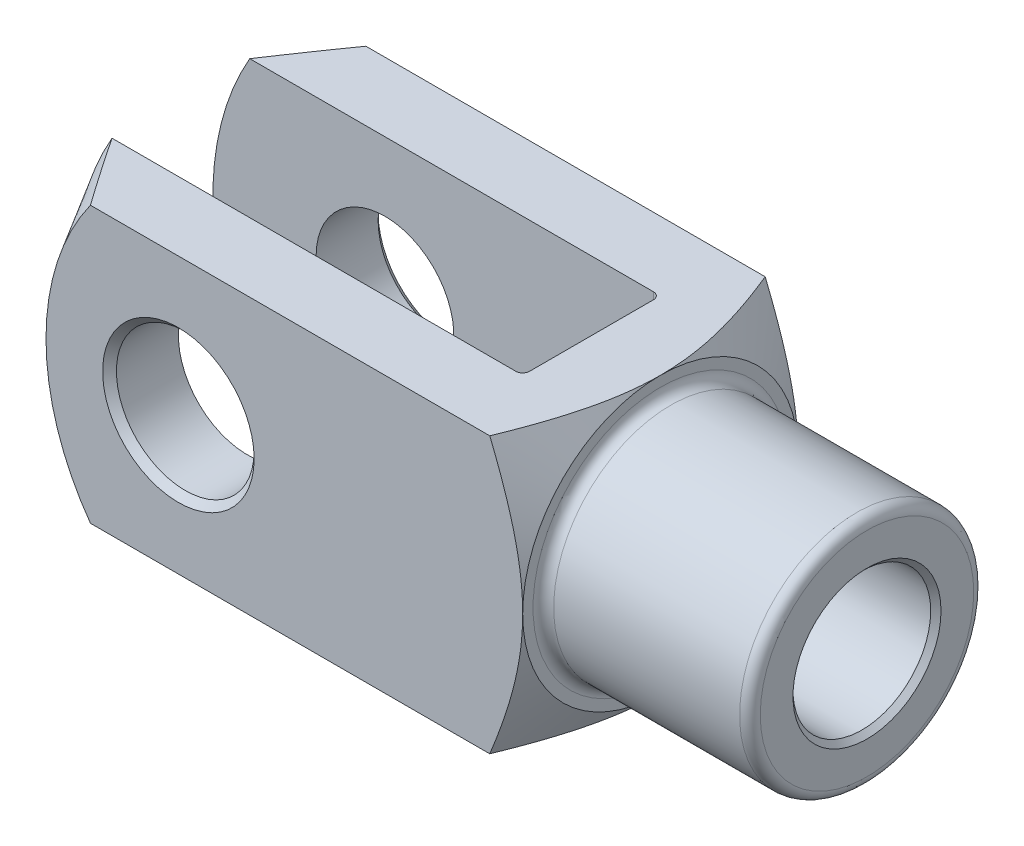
ISO-10303-21;
HEADER;
FILE_DESCRIPTION(('STEP AP214'),'2;1');
FILE_NAME('part.step','',(''),(''),'','','');
FILE_SCHEMA(('AUTOMOTIVE_DESIGN { 1 0 10303 214 1 1 1 1 }'));
ENDSEC;
DATA;
#1=APPLICATION_CONTEXT('core data for automotive mechanical design processes');
#2=APPLICATION_PROTOCOL_DEFINITION('international standard','automotive_design',2000,#1);
#3=PRODUCT_CONTEXT('',#1,'mechanical');
#4=PRODUCT('Part','Part','',(#3));
#5=PRODUCT_RELATED_PRODUCT_CATEGORY('part','',(#4));
#6=PRODUCT_DEFINITION_FORMATION('','',#4);
#7=PRODUCT_DEFINITION_CONTEXT('part definition',#1,'design');
#8=PRODUCT_DEFINITION('design','',#6,#7);
#9=PRODUCT_DEFINITION_SHAPE('','',#8);
#10=(LENGTH_UNIT() NAMED_UNIT(*) SI_UNIT(.MILLI.,.METRE.));
#11=(NAMED_UNIT(*) PLANE_ANGLE_UNIT() SI_UNIT($,.RADIAN.));
#12=(NAMED_UNIT(*) SI_UNIT($,.STERADIAN.) SOLID_ANGLE_UNIT());
#13=UNCERTAINTY_MEASURE_WITH_UNIT(LENGTH_MEASURE(1.E-05),#10,'distance_accuracy_value','');
#14=(GEOMETRIC_REPRESENTATION_CONTEXT(3) GLOBAL_UNCERTAINTY_ASSIGNED_CONTEXT((#13)) GLOBAL_UNIT_ASSIGNED_CONTEXT((#10,
#11,#12)) REPRESENTATION_CONTEXT('',''));
#15=CARTESIAN_POINT('',(0.,0.,0.));
#16=DIRECTION('',(0.,0.,1.));
#17=DIRECTION('',(1.,0.,0.));
#18=AXIS2_PLACEMENT_3D('',#15,#16,#17);
#19=CARTESIAN_POINT('',(-41.,-20.,-8.99999999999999));
#20=DIRECTION('',(0.,-1.,0.));
#21=DIRECTION('',(0.,0.,-1.));
#22=AXIS2_PLACEMENT_3D('',#19,#20,#21);
#23=CYLINDRICAL_SURFACE('',#22,1.);
#24=DIRECTION('',(0.,1.,0.));
#25=VECTOR('',#24,1.);
#26=CARTESIAN_POINT('',(-40.,-20.,-8.99999999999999));
#27=LINE('',#26,#25);
#28=CARTESIAN_POINT('',(-40.,-4.3588989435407,-8.99999999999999));
#29=VERTEX_POINT('',#28);
#30=CARTESIAN_POINT('',(-40.,-20.,-8.99999999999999));
#31=VERTEX_POINT('',#30);
#32=EDGE_CURVE('E358',#29,#31,#27,.F.);
#33=ORIENTED_EDGE('',*,*,#32,.F.);
#34=CARTESIAN_POINT('',(-40.,-4.3588989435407,-8.99999999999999));
#35=CARTESIAN_POINT('',(-40.0000151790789,-4.28657646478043,-9.03502940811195));
#36=CARTESIAN_POINT('',(-40.0018397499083,-4.21384835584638,-9.06917502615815));
#37=CARTESIAN_POINT('',(-40.0086750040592,-4.06774424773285,-9.13563818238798));
#38=CARTESIAN_POINT('',(-40.0136843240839,-3.99436853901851,-9.1679564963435));
#39=CARTESIAN_POINT('',(-40.0264446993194,-3.84721416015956,-9.23067336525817));
#40=CARTESIAN_POINT('',(-40.0341903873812,-3.77343655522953,-9.26107554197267));
#41=CARTESIAN_POINT('',(-40.0520865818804,-3.62542416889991,-9.32001323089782));
#42=CARTESIAN_POINT('',(-40.0622373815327,-3.55118933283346,-9.34854851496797));
#43=CARTESIAN_POINT('',(-40.0957491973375,-3.32854256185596,-9.4311073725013));
#44=CARTESIAN_POINT('',(-40.1222296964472,-3.17955672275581,-9.48235268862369));
#45=CARTESIAN_POINT('',(-40.1816529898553,-2.88046339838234,-9.57745203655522));
#46=CARTESIAN_POINT('',(-40.2145999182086,-2.73035525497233,-9.62130130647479));
#47=CARTESIAN_POINT('',(-40.2998777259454,-2.36825595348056,-9.71798906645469));
#48=CARTESIAN_POINT('',(-40.3546487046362,-2.1558749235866,-9.76725305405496));
#49=CARTESIAN_POINT('',(-40.470872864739,-1.73020697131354,-9.85157380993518));
#50=CARTESIAN_POINT('',(-40.5323270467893,-1.51691991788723,-9.88662844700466));
#51=CARTESIAN_POINT('',(-40.7230029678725,-0.876019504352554,-9.97086857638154));
#52=CARTESIAN_POINT('',(-40.8585728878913,-0.447232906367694,-9.99916563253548));
#53=CARTESIAN_POINT('',(-40.995979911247,-0.0127126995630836,-9.99999393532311));
#54=CARTESIAN_POINT('',(-40.9979899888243,-0.00635627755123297,-9.99999999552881));
#55=CARTESIAN_POINT('',(-41.,0.,-9.99999999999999));
#56=B_SPLINE_CURVE_WITH_KNOTS('',3,(#34,#35,#36,#37,#38,#39,#40,#41,#42,#43,#44,#45,#46,#47,#48,
#49,#50,#51,#52,#53,#54,#55),.UNSPECIFIED.,.F.,.F.,(4,2,2,2,2,2,2,2,2,2,4),(0.,0.24102239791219,
0.48194169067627,0.722391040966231,0.962869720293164,1.44176483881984,1.9209671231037,
2.59465687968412,3.26844764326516,4.61560355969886,4.63560356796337),.UNSPECIFIED.);
#57=CARTESIAN_POINT('',(-41.,0.,-9.99999999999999));
#58=VERTEX_POINT('',#57);
#59=EDGE_CURVE('E390',#29,#58,#56,.T.);
#60=ORIENTED_EDGE('',*,*,#59,.T.);
#61=DIRECTION('',(0.,1.,0.));
#62=VECTOR('',#61,1.);
#63=CARTESIAN_POINT('',(-41.,20.,-9.99999999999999));
#64=LINE('',#63,#62);
#65=CARTESIAN_POINT('',(-41.,-20.,-9.99999999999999));
#66=VERTEX_POINT('',#65);
#67=EDGE_CURVE('E183',#66,#58,#64,.T.);
#68=ORIENTED_EDGE('',*,*,#67,.F.);
#69=CARTESIAN_POINT('',(-41.,-20.,-8.99999999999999));
#70=DIRECTION('',(0.,-1.,0.));
#71=DIRECTION('',(0.,0.,-1.));
#72=AXIS2_PLACEMENT_3D('',#69,#70,#71);
#73=CIRCLE('',#72,1.);
#74=EDGE_CURVE('E198',#31,#66,#73,.F.);
#75=ORIENTED_EDGE('',*,*,#74,.F.);
#76=EDGE_LOOP('',(#33,#60,#68,#75));
#77=FACE_BOUND('',#76,.T.);
#78=ADVANCED_FACE('F37',(#77),#23,.F.);
#79=CARTESIAN_POINT('',(-40.,-20.,-9.99999999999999));
#80=DIRECTION('',(1.,0.,0.));
#81=DIRECTION('',(0.,0.,-1.));
#82=AXIS2_PLACEMENT_3D('',#79,#80,#81);
#83=PLANE('',#82);
#84=CARTESIAN_POINT('',(-40.,20.,-8.99999999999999));
#85=VERTEX_POINT('',#84);
#86=CARTESIAN_POINT('',(-40.,4.3588989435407,-8.99999999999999));
#87=VERTEX_POINT('',#86);
#88=EDGE_CURVE('E373',#85,#87,#27,.F.);
#89=ORIENTED_EDGE('',*,*,#88,.T.);
#90=CARTESIAN_POINT('',(-40.,0.,0.));
#91=DIRECTION('',(1.,0.,0.));
#92=DIRECTION('',(0.,0.,-1.));
#93=AXIS2_PLACEMENT_3D('',#90,#91,#92);
#94=CIRCLE('',#93,10.);
#95=CARTESIAN_POINT('',(-40.,4.35889894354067,9.));
#96=VERTEX_POINT('',#95);
#97=EDGE_CURVE('E757',#87,#96,#94,.T.);
#98=ORIENTED_EDGE('',*,*,#97,.T.);
#99=DIRECTION('',(0.,1.,0.));
#100=VECTOR('',#99,1.);
#101=CARTESIAN_POINT('',(-40.,20.,9.));
#102=LINE('',#101,#100);
#103=CARTESIAN_POINT('',(-40.,20.,9.));
#104=VERTEX_POINT('',#103);
#105=EDGE_CURVE('E160',#96,#104,#102,.T.);
#106=ORIENTED_EDGE('',*,*,#105,.T.);
#107=DIRECTION('',(0.,0.,-1.));
#108=VECTOR('',#107,1.);
#109=CARTESIAN_POINT('',(-40.,20.,-9.99999999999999));
#110=LINE('',#109,#108);
#111=EDGE_CURVE('E338',#104,#85,#110,.T.);
#112=ORIENTED_EDGE('',*,*,#111,.T.);
#113=EDGE_LOOP('',(#89,#98,#106,#112));
#114=FACE_BOUND('',#113,.T.);
#115=ADVANCED_FACE('F484',(#114),#83,.F.);
#116=CARTESIAN_POINT('',(-41.,-20.,9.));
#117=DIRECTION('',(0.,-1.,0.));
#118=DIRECTION('',(0.,0.,-1.));
#119=AXIS2_PLACEMENT_3D('',#116,#117,#118);
#120=CYLINDRICAL_SURFACE('',#119,1.);
#121=ORIENTED_EDGE('',*,*,#105,.F.);
#122=CARTESIAN_POINT('',(-40.,4.35889894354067,9.));
#123=CARTESIAN_POINT('',(-40.0000151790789,4.28657646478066,9.03502940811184));
#124=CARTESIAN_POINT('',(-40.0018397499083,4.21384835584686,9.06917502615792));
#125=CARTESIAN_POINT('',(-40.0086750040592,4.06774424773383,9.13563818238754));
#126=CARTESIAN_POINT('',(-40.0136843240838,3.99436853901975,9.16795649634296));
#127=CARTESIAN_POINT('',(-40.0264446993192,3.84721416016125,9.23067336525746));
#128=CARTESIAN_POINT('',(-40.0341903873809,3.77343655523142,9.26107554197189));
#129=CARTESIAN_POINT('',(-40.0520865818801,3.62542416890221,9.32001323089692));
#130=CARTESIAN_POINT('',(-40.0622373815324,3.55118933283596,9.34854851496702));
#131=CARTESIAN_POINT('',(-40.0957491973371,3.32854256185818,9.43110737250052));
#132=CARTESIAN_POINT('',(-40.1222296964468,3.17955672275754,9.48235268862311));
#133=CARTESIAN_POINT('',(-40.1816529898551,2.88046339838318,9.57745203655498));
#134=CARTESIAN_POINT('',(-40.2145999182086,2.73035525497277,9.62130130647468));
#135=CARTESIAN_POINT('',(-40.2998777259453,2.36825595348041,9.71798906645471));
#136=CARTESIAN_POINT('',(-40.3546487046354,2.15587492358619,9.767253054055));
#137=CARTESIAN_POINT('',(-40.4708728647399,1.73020697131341,9.85157380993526));
#138=CARTESIAN_POINT('',(-40.5323270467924,1.51691991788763,9.88662844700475));
#139=CARTESIAN_POINT('',(-40.7230029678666,0.876019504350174,9.97086857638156));
#140=CARTESIAN_POINT('',(-40.8585728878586,0.447232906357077,9.99916563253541));
#141=CARTESIAN_POINT('',(-40.995979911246,0.0127126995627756,9.99999393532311));
#142=CARTESIAN_POINT('',(-40.9979899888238,0.00635627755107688,9.99999999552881));
#143=CARTESIAN_POINT('',(-41.,0.,10.));
#144=B_SPLINE_CURVE_WITH_KNOTS('',3,(#122,#123,#124,#125,#126,#127,#128,#129,#130,#131,#132,
#133,#134,#135,#136,#137,#138,#139,#140,#141,#142,#143),.UNSPECIFIED.,.F.,.F.,(4,2,2,2,2,2,2,2,
2,2,4),(0.,0.241022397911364,0.48194169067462,0.722391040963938,0.962869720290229,
1.44176483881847,1.92096712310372,2.59465687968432,3.26844764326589,4.61560355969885,
4.63560356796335),.UNSPECIFIED.);
#145=CARTESIAN_POINT('',(-41.,0.,10.));
#146=VERTEX_POINT('',#145);
#147=EDGE_CURVE('E145',#96,#146,#144,.T.);
#148=ORIENTED_EDGE('',*,*,#147,.T.);
#149=DIRECTION('',(0.,1.,0.));
#150=VECTOR('',#149,1.);
#151=CARTESIAN_POINT('',(-41.,-20.,10.));
#152=LINE('',#151,#150);
#153=CARTESIAN_POINT('',(-41.,20.,10.));
#154=VERTEX_POINT('',#153);
#155=EDGE_CURVE('E159',#154,#146,#152,.F.);
#156=ORIENTED_EDGE('',*,*,#155,.F.);
#157=CARTESIAN_POINT('',(-41.,20.,9.));
#158=DIRECTION('',(0.,1.,0.));
#159=DIRECTION('',(0.,0.,1.));
#160=AXIS2_PLACEMENT_3D('',#157,#158,#159);
#161=CIRCLE('',#160,1.);
#162=EDGE_CURVE('E190',#104,#154,#161,.F.);
#163=ORIENTED_EDGE('',*,*,#162,.F.);
#164=EDGE_LOOP('',(#121,#148,#156,#163));
#165=FACE_BOUND('',#164,.T.);
#166=ADVANCED_FACE('F156',(#165),#120,.F.);
#167=CARTESIAN_POINT('',(-105.,-20.,-9.99999999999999));
#168=DIRECTION('',(0.,0.,-1.));
#169=DIRECTION('',(-1.,0.,0.));
#170=AXIS2_PLACEMENT_3D('',#167,#168,#169);
#171=PLANE('',#170);
#172=CARTESIAN_POINT('',(-80.,0.,-9.99999999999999));
#173=DIRECTION('',(0.,0.,-1.));
#174=DIRECTION('',(-1.,0.,0.));
#175=AXIS2_PLACEMENT_3D('',#172,#173,#174);
#176=CIRCLE('',#175,9.99999999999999);
#177=CARTESIAN_POINT('',(-90.,0.,-9.99999999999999));
#178=VERTEX_POINT('',#177);
#179=EDGE_CURVE('E367',#178,#178,#176,.F.);
#180=ORIENTED_EDGE('',*,*,#179,.F.);
#181=EDGE_LOOP('',(#180));
#182=FACE_BOUND('',#181,.T.);
#183=CARTESIAN_POINT('',(-65.,0.,-9.99999999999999));
#184=DIRECTION('',(0.,0.,1.));
#185=DIRECTION('',(1.,0.,0.));
#186=AXIS2_PLACEMENT_3D('',#183,#184,#185);
#187=CIRCLE('',#186,40.);
#188=CARTESIAN_POINT('',(-99.6410161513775,20.,-9.99999999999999));
#189=VERTEX_POINT('',#188);
#190=CARTESIAN_POINT('',(-99.6410161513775,-20.,-9.99999999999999));
#191=VERTEX_POINT('',#190);
#192=EDGE_CURVE('E276',#189,#191,#187,.T.);
#193=ORIENTED_EDGE('',*,*,#192,.T.);
#194=DIRECTION('',(-1.,0.,0.));
#195=VECTOR('',#194,1.);
#196=CARTESIAN_POINT('',(-105.,-20.,-9.99999999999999));
#197=LINE('',#196,#195);
#198=EDGE_CURVE('E333',#66,#191,#197,.T.);
#199=ORIENTED_EDGE('',*,*,#198,.F.);
#200=ORIENTED_EDGE('',*,*,#67,.T.);
#201=CARTESIAN_POINT('',(-41.,20.,-9.99999999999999));
#202=VERTEX_POINT('',#201);
#203=EDGE_CURVE('E179',#58,#202,#64,.T.);
#204=ORIENTED_EDGE('',*,*,#203,.T.);
#205=DIRECTION('',(-1.,0.,0.));
#206=VECTOR('',#205,1.);
#207=CARTESIAN_POINT('',(-105.,20.,-9.99999999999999));
#208=LINE('',#207,#206);
#209=EDGE_CURVE('E346',#202,#189,#208,.T.);
#210=ORIENTED_EDGE('',*,*,#209,.T.);
#211=EDGE_LOOP('',(#193,#199,#200,#204,#210));
#212=FACE_BOUND('',#211,.T.);
#213=ADVANCED_FACE('F393',(#182,#212),#171,.F.);
#214=CARTESIAN_POINT('',(-105.,-20.,10.));
#215=DIRECTION('',(0.,0.,1.));
#216=DIRECTION('',(1.,0.,0.));
#217=AXIS2_PLACEMENT_3D('',#214,#215,#216);
#218=PLANE('',#217);
#219=CARTESIAN_POINT('',(-80.,0.,10.));
#220=DIRECTION('',(0.,0.,1.));
#221=DIRECTION('',(1.,0.,0.));
#222=AXIS2_PLACEMENT_3D('',#219,#220,#221);
#223=CIRCLE('',#222,9.99999999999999);
#224=CARTESIAN_POINT('',(-70.,0.,10.));
#225=VERTEX_POINT('',#224);
#226=EDGE_CURVE('E345',#225,#225,#223,.F.);
#227=ORIENTED_EDGE('',*,*,#226,.F.);
#228=EDGE_LOOP('',(#227));
#229=FACE_BOUND('',#228,.T.);
#230=DIRECTION('',(1.,0.,0.));
#231=VECTOR('',#230,1.);
#232=CARTESIAN_POINT('',(-105.,-20.,10.));
#233=LINE('',#232,#231);
#234=CARTESIAN_POINT('',(-99.6410161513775,-20.,10.));
#235=VERTEX_POINT('',#234);
#236=CARTESIAN_POINT('',(-41.,-20.,10.));
#237=VERTEX_POINT('',#236);
#238=EDGE_CURVE('E337',#235,#237,#233,.T.);
#239=ORIENTED_EDGE('',*,*,#238,.F.);
#240=CARTESIAN_POINT('',(-65.,0.,10.));
#241=DIRECTION('',(0.,0.,1.));
#242=DIRECTION('',(1.,0.,0.));
#243=AXIS2_PLACEMENT_3D('',#240,#241,#242);
#244=CIRCLE('',#243,40.);
#245=CARTESIAN_POINT('',(-99.6410161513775,20.,10.));
#246=VERTEX_POINT('',#245);
#247=EDGE_CURVE('E437',#246,#235,#244,.T.);
#248=ORIENTED_EDGE('',*,*,#247,.F.);
#249=DIRECTION('',(1.,0.,0.));
#250=VECTOR('',#249,1.);
#251=CARTESIAN_POINT('',(-105.,20.,10.));
#252=LINE('',#251,#250);
#253=EDGE_CURVE('E176',#246,#154,#252,.T.);
#254=ORIENTED_EDGE('',*,*,#253,.T.);
#255=ORIENTED_EDGE('',*,*,#155,.T.);
#256=EDGE_CURVE('E164',#146,#237,#152,.F.);
#257=ORIENTED_EDGE('',*,*,#256,.T.);
#258=EDGE_LOOP('',(#239,#248,#254,#255,#257));
#259=FACE_BOUND('',#258,.T.);
#260=ADVANCED_FACE('F173',(#229,#259),#218,.F.);
#261=CARTESIAN_POINT('',(-105.,-20.,20.));
#262=DIRECTION('',(0.,0.,1.));
#263=DIRECTION('',(1.,0.,0.));
#264=AXIS2_PLACEMENT_3D('',#261,#262,#263);
#265=PLANE('',#264);
#266=CARTESIAN_POINT('',(-80.,0.,20.));
#267=DIRECTION('',(0.,0.,1.));
#268=DIRECTION('',(1.,0.,0.));
#269=AXIS2_PLACEMENT_3D('',#266,#267,#268);
#270=CIRCLE('',#269,11.);
#271=CARTESIAN_POINT('',(-69.,0.,20.));
#272=VERTEX_POINT('',#271);
#273=EDGE_CURVE('E228',#272,#272,#270,.F.);
#274=ORIENTED_EDGE('',*,*,#273,.T.);
#275=EDGE_LOOP('',(#274));
#276=FACE_BOUND('',#275,.T.);
#277=DIRECTION('',(1.,0.,0.));
#278=VECTOR('',#277,1.);
#279=CARTESIAN_POINT('',(-105.,20.,20.));
#280=LINE('',#279,#278);
#281=CARTESIAN_POINT('',(-92.7750448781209,20.,20.));
#282=VERTEX_POINT('',#281);
#283=CARTESIAN_POINT('',(-34.7829262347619,20.,20.));
#284=VERTEX_POINT('',#283);
#285=EDGE_CURVE('E364',#282,#284,#280,.T.);
#286=ORIENTED_EDGE('',*,*,#285,.F.);
#287=CARTESIAN_POINT('',(-65.,0.,20.));
#288=DIRECTION('',(0.,0.,1.));
#289=DIRECTION('',(1.,0.,0.));
#290=AXIS2_PLACEMENT_3D('',#287,#288,#289);
#291=CIRCLE('',#290,34.2264973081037);
#292=CARTESIAN_POINT('',(-92.7750448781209,-20.,20.));
#293=VERTEX_POINT('',#292);
#294=EDGE_CURVE('E61',#282,#293,#291,.T.);
#295=ORIENTED_EDGE('',*,*,#294,.T.);
#296=DIRECTION('',(1.,0.,0.));
#297=VECTOR('',#296,1.);
#298=CARTESIAN_POINT('',(-105.,-20.,20.));
#299=LINE('',#298,#297);
#300=CARTESIAN_POINT('',(-34.7829262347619,-20.,20.));
#301=VERTEX_POINT('',#300);
#302=EDGE_CURVE('E361',#293,#301,#299,.T.);
#303=ORIENTED_EDGE('',*,*,#302,.T.);
#304=CARTESIAN_POINT('',(-44.7117469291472,-40.8480870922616,20.));
#305=CARTESIAN_POINT('',(-44.4561917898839,-40.3552393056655,20.));
#306=CARTESIAN_POINT('',(-44.2013369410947,-39.8620284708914,20.));
#307=CARTESIAN_POINT('',(-43.693177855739,-38.874806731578,20.));
#308=CARTESIAN_POINT('',(-43.4398736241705,-38.3807958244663,20.));
#309=CARTESIAN_POINT('',(-42.6824888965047,-36.8974069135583,20.));
#310=CARTESIAN_POINT('',(-42.1809621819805,-35.9067224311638,20.));
#311=CARTESIAN_POINT('',(-41.18538005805,-33.9194417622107,20.));
#312=CARTESIAN_POINT('',(-40.6913391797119,-32.9228382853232,20.));
#313=CARTESIAN_POINT('',(-39.7136550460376,-30.9245603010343,20.));
#314=CARTESIAN_POINT('',(-39.2300116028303,-29.9228858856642,20.));
#315=CARTESIAN_POINT('',(-38.2464042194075,-27.8515018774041,20.));
#316=CARTESIAN_POINT('',(-37.7472668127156,-26.7813979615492,20.));
#317=CARTESIAN_POINT('',(-37.0128527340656,-25.1696896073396,20.));
#318=CARTESIAN_POINT('',(-36.7704219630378,-24.6313428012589,20.));
#319=CARTESIAN_POINT('',(-36.2910428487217,-23.5522150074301,20.));
#320=CARTESIAN_POINT('',(-36.0540944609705,-23.0114340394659,20.));
#321=CARTESIAN_POINT('',(-35.5865923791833,-21.9273871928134,20.));
#322=CARTESIAN_POINT('',(-35.356035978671,-21.3841224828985,20.));
#323=CARTESIAN_POINT('',(-34.9021820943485,-20.2945711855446,20.));
#324=CARTESIAN_POINT('',(-34.6788845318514,-19.748284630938,20.));
#325=CARTESIAN_POINT('',(-34.2407069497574,-18.6523948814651,20.));
#326=CARTESIAN_POINT('',(-34.0258261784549,-18.1027919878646,20.));
#327=CARTESIAN_POINT('',(-33.6058159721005,-16.999875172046,20.));
#328=CARTESIAN_POINT('',(-33.4006864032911,-16.4465613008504,20.));
#329=CARTESIAN_POINT('',(-32.9584948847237,-15.2154115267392,20.));
#330=CARTESIAN_POINT('',(-32.724154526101,-14.5365922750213,20.));
#331=CARTESIAN_POINT('',(-32.2756396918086,-13.1723527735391,20.));
#332=CARTESIAN_POINT('',(-32.061463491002,-12.4869330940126,20.));
#333=CARTESIAN_POINT('',(-31.6572524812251,-11.1089764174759,20.));
#334=CARTESIAN_POINT('',(-31.4672171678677,-10.4164395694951,20.));
#335=CARTESIAN_POINT('',(-31.115826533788,-9.02406913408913,20.));
#336=CARTESIAN_POINT('',(-30.9544708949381,-8.32423562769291,20.));
#337=CARTESIAN_POINT('',(-30.6686985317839,-6.93411418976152,20.));
#338=CARTESIAN_POINT('',(-30.543503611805,-6.24398781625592,20.));
#339=CARTESIAN_POINT('',(-30.329515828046,-4.85806653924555,20.));
#340=CARTESIAN_POINT('',(-30.2407217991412,-4.16227181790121,20.));
#341=CARTESIAN_POINT('',(-30.1032474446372,-2.76713808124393,20.));
#342=CARTESIAN_POINT('',(-30.0545409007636,-2.06780168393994,20.));
#343=CARTESIAN_POINT('',(-29.9993902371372,-0.667457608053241,20.));
#344=CARTESIAN_POINT('',(-29.9929446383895,0.0335500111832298,20.));
#345=CARTESIAN_POINT('',(-30.0215257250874,1.38358015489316,20.));
#346=CARTESIAN_POINT('',(-30.053564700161,2.03266864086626,20.));
#347=CARTESIAN_POINT('',(-30.1529107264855,3.32811214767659,20.));
#348=CARTESIAN_POINT('',(-30.2202176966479,3.97446717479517,20.));
#349=CARTESIAN_POINT('',(-30.3876322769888,5.26320613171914,20.));
#350=CARTESIAN_POINT('',(-30.4877568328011,5.90558783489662,20.));
#351=CARTESIAN_POINT('',(-30.7175054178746,7.18501977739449,20.));
#352=CARTESIAN_POINT('',(-30.8471302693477,7.82206986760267,20.));
#353=CARTESIAN_POINT('',(-31.1364002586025,9.10865741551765,20.));
#354=CARTESIAN_POINT('',(-31.2968057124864,9.75802261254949,20.));
#355=CARTESIAN_POINT('',(-31.6411635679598,11.0504361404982,20.));
#356=CARTESIAN_POINT('',(-31.8251161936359,11.6934844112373,20.));
#357=CARTESIAN_POINT('',(-32.2130089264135,12.9734650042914,20.));
#358=CARTESIAN_POINT('',(-32.4169481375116,13.6103975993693,20.));
#359=CARTESIAN_POINT('',(-32.7355110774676,14.5615046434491,20.));
#360=CARTESIAN_POINT('',(-32.8438059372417,14.8778200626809,20.));
#361=CARTESIAN_POINT('',(-33.0642784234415,15.5090943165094,20.));
#362=CARTESIAN_POINT('',(-33.1764560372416,15.8240531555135,20.));
#363=CARTESIAN_POINT('',(-33.5368964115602,16.8182188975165,20.));
#364=CARTESIAN_POINT('',(-33.7917035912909,17.4950585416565,20.));
#365=CARTESIAN_POINT('',(-34.315152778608,18.8433829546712,20.));
#366=CARTESIAN_POINT('',(-34.5837956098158,19.5148674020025,20.));
#367=CARTESIAN_POINT('',(-35.1326821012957,20.8532445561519,20.));
#368=CARTESIAN_POINT('',(-35.412928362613,21.5201361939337,20.));
#369=CARTESIAN_POINT('',(-35.9830913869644,22.8497479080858,20.));
#370=CARTESIAN_POINT('',(-36.2730079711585,23.5124680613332,20.));
#371=CARTESIAN_POINT('',(-36.86125118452,24.8348444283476,20.));
#372=CARTESIAN_POINT('',(-37.1595848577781,25.4944975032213,20.));
#373=CARTESIAN_POINT('',(-37.7631804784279,26.8106245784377,20.));
#374=CARTESIAN_POINT('',(-38.0684424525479,27.4670985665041,20.));
#375=CARTESIAN_POINT('',(-38.6848375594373,28.7771877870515,20.));
#376=CARTESIAN_POINT('',(-38.9959700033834,29.4308033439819,20.));
#377=CARTESIAN_POINT('',(-39.6233091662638,30.735596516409,20.));
#378=CARTESIAN_POINT('',(-39.9395159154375,31.3867741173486,20.));
#379=CARTESIAN_POINT('',(-40.896609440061,33.3410563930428,20.));
#380=CARTESIAN_POINT('',(-41.5440877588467,34.6409339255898,20.));
#381=CARTESIAN_POINT('',(-42.8522843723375,37.234022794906,20.));
#382=CARTESIAN_POINT('',(-43.5130029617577,38.5272339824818,20.));
#383=CARTESIAN_POINT('',(-44.8443480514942,41.1077325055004,20.));
#384=CARTESIAN_POINT('',(-45.5149695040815,42.3950224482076,20.));
#385=CARTESIAN_POINT('',(-46.8642487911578,44.9653657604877,20.));
#386=CARTESIAN_POINT('',(-47.5429065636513,46.2484191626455,20.));
#387=CARTESIAN_POINT('',(-48.8053932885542,48.6208089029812,20.));
#388=CARTESIAN_POINT('',(-49.3883375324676,49.7106165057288,20.));
#389=CARTESIAN_POINT('',(-50.5581313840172,51.8881346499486,20.));
#390=CARTESIAN_POINT('',(-51.1449809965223,52.9758451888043,20.));
#391=CARTESIAN_POINT('',(-52.3220562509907,55.1496344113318,20.));
#392=CARTESIAN_POINT('',(-52.9122823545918,56.2357128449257,20.));
#393=CARTESIAN_POINT('',(-54.0955388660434,58.4063411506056,20.));
#394=CARTESIAN_POINT('',(-54.6885692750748,59.4908910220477,20.));
#395=CARTESIAN_POINT('',(-55.8736310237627,61.6524632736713,20.));
#396=CARTESIAN_POINT('',(-56.4656486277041,62.7294931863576,20.));
#397=CARTESIAN_POINT('',(-57.651739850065,64.8824205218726,20.));
#398=CARTESIAN_POINT('',(-58.2458134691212,65.9583179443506,20.));
#399=CARTESIAN_POINT('',(-59.4356534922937,68.1089540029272,20.));
#400=CARTESIAN_POINT('',(-60.0314196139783,69.1836927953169,20.));
#401=CARTESIAN_POINT('',(-61.2245219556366,71.3322969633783,20.));
#402=CARTESIAN_POINT('',(-61.8218581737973,72.4061623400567,20.));
#403=CARTESIAN_POINT('',(-62.4198720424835,73.4796497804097,20.));
#404=B_SPLINE_CURVE_WITH_KNOTS('',3,(#304,#305,#306,#307,#308,#309,#310,#311,#312,#313,#314,
#315,#316,#317,#318,#319,#320,#321,#322,#323,#324,#325,#326,#327,#328,#329,#330,#331,#332,#333,
#334,#335,#336,#337,#338,#339,#340,#341,#342,#343,#344,#345,#346,#347,#348,#349,#350,#351,#352,
#353,#354,#355,#356,#357,#358,#359,#360,#361,#362,#363,#364,#365,#366,#367,#368,#369,#370,#371,
#372,#373,#374,#375,#376,#377,#378,#379,#380,#381,#382,#383,#384,#385,#386,#387,#388,#389,#390,
#391,#392,#393,#394,#395,#396,#397,#398,#399,#400,#401,#402,#403),.UNSPECIFIED.,.F.,.F.,(4,2,2,
2,2,2,2,2,2,2,2,2,2,2,2,2,2,2,2,2,2,2,2,2,2,2,2,2,2,2,2,2,2,2,2,2,2,2,2,2,2,2,2,2,2,2,2,2,2,4),
(0.,1.66549183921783,3.33098904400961,6.66215149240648,9.9991147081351,13.3360175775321,
16.8782159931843,18.6494369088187,20.4206434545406,22.1910882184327,23.961513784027,
25.7317808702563,27.5020236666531,29.6561476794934,31.8100872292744,33.9639817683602,
36.117852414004,38.2211628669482,40.3244059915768,42.4262724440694,44.5280653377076,
46.4767082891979,48.4253467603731,50.3749930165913,52.324693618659,54.3308265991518,
56.3369786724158,58.3430408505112,59.346040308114,60.3490365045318,62.5184742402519,
64.6880412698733,66.8580972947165,69.0281132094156,71.2000024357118,73.3719000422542,
75.5435443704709,77.7152016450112,82.0717130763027,86.4283215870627,90.7827812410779,
95.1372073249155,98.8449661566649,102.552729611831,106.261012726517,109.969297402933,
113.656340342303,117.343384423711,121.02984567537,124.716302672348),.UNSPECIFIED.);
#405=CARTESIAN_POINT('',(-30.,0.,20.));
#406=VERTEX_POINT('',#405);
#407=EDGE_CURVE('E305',#406,#301,#404,.F.);
#408=ORIENTED_EDGE('',*,*,#407,.F.);
#409=EDGE_CURVE('E303',#284,#406,#404,.F.);
#410=ORIENTED_EDGE('',*,*,#409,.F.);
#411=EDGE_LOOP('',(#286,#295,#303,#408,#410));
#412=FACE_BOUND('',#411,.T.);
#413=ADVANCED_FACE('F287',(#276,#412),#265,.T.);
#414=CARTESIAN_POINT('',(-105.,-20.,20.));
#415=DIRECTION('',(0.,-1.,0.));
#416=DIRECTION('',(0.,0.,-1.));
#417=AXIS2_PLACEMENT_3D('',#414,#415,#416);
#418=PLANE('',#417);
#419=ORIENTED_EDGE('',*,*,#198,.T.);
#420=CARTESIAN_POINT('',(-115.464255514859,-20.,14.7388337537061));
#421=CARTESIAN_POINT('',(-114.977726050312,-20.,13.9554262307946));
#422=CARTESIAN_POINT('',(-114.490511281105,-20.,13.1724443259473));
#423=CARTESIAN_POINT('',(-113.514581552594,-20.,11.6074156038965));
#424=CARTESIAN_POINT('',(-113.025866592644,-20.,10.8253687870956));
#425=CARTESIAN_POINT('',(-111.557258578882,-20.,8.48072725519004));
#426=CARTESIAN_POINT('',(-110.574921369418,-20.,6.91966204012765));
#427=CARTESIAN_POINT('',(-108.601276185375,-20.,3.8005981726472));
#428=CARTESIAN_POINT('',(-107.609958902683,-20.,2.24260540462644));
#429=CARTESIAN_POINT('',(-106.115876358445,-20.,-0.0898192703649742));
#430=CARTESIAN_POINT('',(-105.616667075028,-20.,-0.866529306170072));
#431=CARTESIAN_POINT('',(-104.615610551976,-20.,-2.41825426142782));
#432=CARTESIAN_POINT('',(-104.113763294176,-20.,-3.19326916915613));
#433=CARTESIAN_POINT('',(-102.561953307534,-20.,-5.57992347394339));
#434=CARTESIAN_POINT('',(-101.50712682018,-20.,-7.18841108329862));
#435=CARTESIAN_POINT('',(-99.9129242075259,-20.,-9.59319983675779));
#436=CARTESIAN_POINT('',(-99.3795310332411,-20.,-10.3934700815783));
#437=CARTESIAN_POINT('',(-98.3082095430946,-20.,-11.9909680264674));
#438=CARTESIAN_POINT('',(-97.7702812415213,-20.,-12.7881957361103));
#439=CARTESIAN_POINT('',(-96.6896618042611,-20.,-14.3785600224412));
#440=CARTESIAN_POINT('',(-96.146974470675,-20.,-15.1716991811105));
#441=CARTESIAN_POINT('',(-95.0556912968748,-20.,-16.7539080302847));
#442=CARTESIAN_POINT('',(-94.507095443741,-20.,-17.5429777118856));
#443=CARTESIAN_POINT('',(-93.4031123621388,-20.,-19.116302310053));
#444=CARTESIAN_POINT('',(-92.8477254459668,-20.,-19.9005574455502));
#445=CARTESIAN_POINT('',(-91.7290307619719,-20.,-21.4633921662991));
#446=CARTESIAN_POINT('',(-91.1657230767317,-20.,-22.2419718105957));
#447=CARTESIAN_POINT('',(-90.0351027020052,-20.,-23.7851048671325));
#448=CARTESIAN_POINT('',(-89.4678762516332,-20.,-24.5497213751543));
#449=CARTESIAN_POINT('',(-88.3226234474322,-20.,-26.0708599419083));
#450=CARTESIAN_POINT('',(-87.7445968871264,-20.,-26.8273818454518));
#451=CARTESIAN_POINT('',(-86.5748512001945,-20.,-28.3314583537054));
#452=CARTESIAN_POINT('',(-85.9831143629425,-20.,-29.0789992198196));
#453=CARTESIAN_POINT('',(-84.7840499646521,-20.,-30.5614329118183));
#454=CARTESIAN_POINT('',(-84.1767232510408,-20.,-31.2963264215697));
#455=CARTESIAN_POINT('',(-82.9493347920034,-20.,-32.7424372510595));
#456=CARTESIAN_POINT('',(-82.3294704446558,-20.,-33.4538210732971));
#457=CARTESIAN_POINT('',(-81.3821904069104,-20.,-34.5053301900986));
#458=CARTESIAN_POINT('',(-81.0634648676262,-20.,-34.8532924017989));
#459=CARTESIAN_POINT('',(-80.4195061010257,-20.,-35.5431342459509));
#460=CARTESIAN_POINT('',(-80.0942730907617,-20.,-35.8850140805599));
#461=CARTESIAN_POINT('',(-79.4372350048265,-20.,-36.5609344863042));
#462=CARTESIAN_POINT('',(-79.105446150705,-20.,-36.8949907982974));
#463=CARTESIAN_POINT('',(-78.4336725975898,-20.,-37.5548111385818));
#464=CARTESIAN_POINT('',(-78.0936875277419,-20.,-37.8805747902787));
#465=CARTESIAN_POINT('',(-77.4046957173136,-20.,-38.5220472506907));
#466=CARTESIAN_POINT('',(-77.0556941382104,-20.,-38.8377615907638));
#467=CARTESIAN_POINT('',(-76.3473531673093,-20.,-39.4573309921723));
#468=CARTESIAN_POINT('',(-75.9880153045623,-20.,-39.7611877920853));
#469=CARTESIAN_POINT('',(-75.4337644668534,-20.,-40.2114960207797));
#470=CARTESIAN_POINT('',(-75.2431118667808,-20.,-40.3632010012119));
#471=CARTESIAN_POINT('',(-74.8584870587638,-20.,-40.6623387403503));
#472=CARTESIAN_POINT('',(-74.6645148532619,-20.,-40.8097715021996));
#473=CARTESIAN_POINT('',(-74.0772413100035,-20.,-41.2450393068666));
#474=CARTESIAN_POINT('',(-73.6786341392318,-20.,-41.5258020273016));
#475=CARTESIAN_POINT('',(-72.8661414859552,-20.,-42.063674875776));
#476=CARTESIAN_POINT('',(-72.4522683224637,-20.,-42.3208035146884));
#477=CARTESIAN_POINT('',(-71.6077007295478,-20.,-42.8058851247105));
#478=CARTESIAN_POINT('',(-71.1770107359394,-20.,-43.0338457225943));
#479=CARTESIAN_POINT('',(-70.3985594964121,-20.,-43.4056496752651));
#480=CARTESIAN_POINT('',(-70.0543057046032,-20.,-43.556816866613));
#481=CARTESIAN_POINT('',(-69.3557183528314,-20.,-43.8338983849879));
#482=CARTESIAN_POINT('',(-69.0013856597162,-20.,-43.9598148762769));
#483=CARTESIAN_POINT('',(-68.2841094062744,-20.,-44.182411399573));
#484=CARTESIAN_POINT('',(-67.921178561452,-20.,-44.2791320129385));
#485=CARTESIAN_POINT('',(-67.1881060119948,-20.,-44.4400017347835));
#486=CARTESIAN_POINT('',(-66.8179646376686,-20.,-44.5041523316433));
#487=CARTESIAN_POINT('',(-66.0694904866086,-20.,-44.5976048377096));
#488=CARTESIAN_POINT('',(-65.6911128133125,-20.,-44.6265519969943));
#489=CARTESIAN_POINT('',(-64.9333496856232,-20.,-44.6470380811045));
#490=CARTESIAN_POINT('',(-64.5539642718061,-20.,-44.6385784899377));
#491=CARTESIAN_POINT('',(-63.7977863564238,-20.,-44.5846599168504));
#492=CARTESIAN_POINT('',(-63.4209943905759,-20.,-44.5391935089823));
#493=CARTESIAN_POINT('',(-62.6733097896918,-20.,-44.4133535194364));
#494=CARTESIAN_POINT('',(-62.3024180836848,-20.,-44.3329744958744));
#495=CARTESIAN_POINT('',(-61.5010820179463,-20.,-44.1227716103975));
#496=CARTESIAN_POINT('',(-61.0723250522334,-20.,-43.9865486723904));
#497=CARTESIAN_POINT('',(-60.2287155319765,-20.,-43.6760654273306));
#498=CARTESIAN_POINT('',(-59.8138708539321,-20.,-43.5017839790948));
#499=CARTESIAN_POINT('',(-59.2021903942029,-20.,-43.2164310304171));
#500=CARTESIAN_POINT('',(-58.9997370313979,-20.,-43.1171417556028));
#501=CARTESIAN_POINT('',(-58.5986091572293,-20.,-42.9113932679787));
#502=CARTESIAN_POINT('',(-58.3999330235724,-20.,-42.8049372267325));
#503=CARTESIAN_POINT('',(-58.00622455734,-20.,-42.5855142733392));
#504=CARTESIAN_POINT('',(-57.8111921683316,-20.,-42.4725474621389));
#505=CARTESIAN_POINT('',(-57.4246406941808,-20.,-42.2407087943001));
#506=CARTESIAN_POINT('',(-57.2331221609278,-20.,-42.1218360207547));
#507=CARTESIAN_POINT('',(-56.5392426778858,-20.,-41.6775875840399));
#508=CARTESIAN_POINT('',(-56.0471261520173,-20.,-41.3361114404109));
#509=CARTESIAN_POINT('',(-55.084062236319,-20.,-40.6244535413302));
#510=CARTESIAN_POINT('',(-54.6131250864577,-20.,-40.2542581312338));
#511=CARTESIAN_POINT('',(-53.6888042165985,-20.,-39.4909076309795));
#512=CARTESIAN_POINT('',(-53.2354560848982,-20.,-39.0977096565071));
#513=CARTESIAN_POINT('',(-52.3447584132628,-20.,-38.2938363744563));
#514=CARTESIAN_POINT('',(-51.9074062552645,-20.,-37.8831639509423));
#515=CARTESIAN_POINT('',(-51.0434779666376,-20.,-37.0449994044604));
#516=CARTESIAN_POINT('',(-50.6169935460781,-20.,-36.6174131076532));
#517=CARTESIAN_POINT('',(-49.7759134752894,-20.,-35.7507127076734));
#518=CARTESIAN_POINT('',(-49.3613182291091,-20.,-35.3115982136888));
#519=CARTESIAN_POINT('',(-48.5428320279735,-20.,-34.4243699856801));
#520=CARTESIAN_POINT('',(-48.1389304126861,-20.,-33.9762660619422));
#521=CARTESIAN_POINT('',(-47.3400472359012,-20.,-33.0722099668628));
#522=CARTESIAN_POINT('',(-46.9450655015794,-20.,-32.6162579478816));
#523=CARTESIAN_POINT('',(-46.0007892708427,-20.,-31.5074230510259));
#524=CARTESIAN_POINT('',(-45.4553790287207,-20.,-30.851233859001));
#525=CARTESIAN_POINT('',(-44.3773944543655,-20.,-29.528217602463));
#526=CARTESIAN_POINT('',(-43.8448226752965,-20.,-28.8613884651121));
#527=CARTESIAN_POINT('',(-42.798651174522,-20.,-27.5294654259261));
#528=CARTESIAN_POINT('',(-42.2848857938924,-20.,-26.8645014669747));
#529=CARTESIAN_POINT('',(-41.5210718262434,-20.,-25.8620207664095));
#530=CARTESIAN_POINT('',(-41.2676429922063,-20.,-25.5270710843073));
#531=CARTESIAN_POINT('',(-40.7628770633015,-20.,-24.8556040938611));
#532=CARTESIAN_POINT('',(-40.5115399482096,-20.,-24.519086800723));
#533=CARTESIAN_POINT('',(-40.2611662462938,-20.,-24.1818536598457));
#534=B_SPLINE_CURVE_WITH_KNOTS('',3,(#420,#421,#422,#423,#424,#425,#426,#427,#428,#429,#430,
#431,#432,#433,#434,#435,#436,#437,#438,#439,#440,#441,#442,#443,#444,#445,#446,#447,#448,#449,
#450,#451,#452,#453,#454,#455,#456,#457,#458,#459,#460,#461,#462,#463,#464,#465,#466,#467,#468,
#469,#470,#471,#472,#473,#474,#475,#476,#477,#478,#479,#480,#481,#482,#483,#484,#485,#486,#487,
#488,#489,#490,#491,#492,#493,#494,#495,#496,#497,#498,#499,#500,#501,#502,#503,#504,#505,#506,
#507,#508,#509,#510,#511,#512,#513,#514,#515,#516,#517,#518,#519,#520,#521,#522,#523,#524,#525,
#526,#527,#528,#529,#530,#531,#532,#533),.UNSPECIFIED.,.F.,.F.,(4,2,2,2,2,2,2,2,2,2,2,2,2,2,2,2,
2,2,2,2,2,2,2,2,2,2,2,2,2,2,2,2,2,2,2,2,2,2,2,2,2,2,2,2,2,2,2,2,2,2,2,2,2,2,2,2,4),(0.,
2.76657575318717,5.53315269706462,11.0664145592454,16.6062810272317,19.3761848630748,
22.1461077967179,27.9165467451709,30.8017500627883,33.6869442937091,36.5700122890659,
39.4530865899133,42.3360288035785,45.2189409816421,48.0749879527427,50.9310895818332,
53.7911127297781,56.6509807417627,59.4811890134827,60.896739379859,62.3122426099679,
63.7245983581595,65.1370181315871,66.5486465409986,67.9600671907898,68.6909476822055,
69.4218276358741,70.8837854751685,72.3445883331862,73.8050084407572,74.9321155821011,
76.059126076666,77.1845627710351,78.3099480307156,79.4465824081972,80.5831716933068,
81.7199891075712,82.8569837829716,84.2044814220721,85.5527294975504,86.2290826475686,
86.9051384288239,87.5811837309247,88.2573343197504,90.0527538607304,91.8490323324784,
93.6487735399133,95.4482188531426,97.2597072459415,99.0712571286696,100.880927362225,
102.690562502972,105.250134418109,107.810211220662,110.331064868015,111.591120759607,
112.851164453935),.UNSPECIFIED.);
#535=CARTESIAN_POINT('',(-92.775044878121,-20.,-20.));
#536=VERTEX_POINT('',#535);
#537=EDGE_CURVE('E275',#191,#536,#534,.T.);
#538=ORIENTED_EDGE('',*,*,#537,.T.);
#539=DIRECTION('',(1.,0.,0.));
#540=VECTOR('',#539,1.);
#541=CARTESIAN_POINT('',(-105.,-20.,-20.));
#542=LINE('',#541,#540);
#543=CARTESIAN_POINT('',(-34.7829262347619,-20.,-20.));
#544=VERTEX_POINT('',#543);
#545=EDGE_CURVE('E359',#536,#544,#542,.T.);
#546=ORIENTED_EDGE('',*,*,#545,.T.);
#547=CARTESIAN_POINT('',(-44.7117469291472,-20.,-40.8480870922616));
#548=CARTESIAN_POINT('',(-44.4561917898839,-20.,-40.3552393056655));
#549=CARTESIAN_POINT('',(-44.2013369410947,-20.,-39.8620284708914));
#550=CARTESIAN_POINT('',(-43.693177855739,-20.,-38.874806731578));
#551=CARTESIAN_POINT('',(-43.4398736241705,-20.,-38.3807958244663));
#552=CARTESIAN_POINT('',(-42.6824888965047,-20.,-36.8974069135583));
#553=CARTESIAN_POINT('',(-42.1809621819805,-20.,-35.9067224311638));
#554=CARTESIAN_POINT('',(-41.18538005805,-20.,-33.9194417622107));
#555=CARTESIAN_POINT('',(-40.6913391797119,-20.,-32.9228382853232));
#556=CARTESIAN_POINT('',(-39.7136550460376,-20.,-30.9245603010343));
#557=CARTESIAN_POINT('',(-39.2300116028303,-20.,-29.9228858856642));
#558=CARTESIAN_POINT('',(-38.2464042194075,-20.,-27.8515018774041));
#559=CARTESIAN_POINT('',(-37.7472668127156,-20.,-26.7813979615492));
#560=CARTESIAN_POINT('',(-37.0128527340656,-20.,-25.1696896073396));
#561=CARTESIAN_POINT('',(-36.7704219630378,-20.,-24.6313428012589));
#562=CARTESIAN_POINT('',(-36.2910428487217,-20.,-23.5522150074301));
#563=CARTESIAN_POINT('',(-36.0540944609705,-20.,-23.0114340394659));
#564=CARTESIAN_POINT('',(-35.5865923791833,-20.,-21.9273871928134));
#565=CARTESIAN_POINT('',(-35.356035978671,-20.,-21.3841224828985));
#566=CARTESIAN_POINT('',(-34.9021820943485,-20.,-20.2945711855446));
#567=CARTESIAN_POINT('',(-34.6788845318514,-20.,-19.748284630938));
#568=CARTESIAN_POINT('',(-34.2407069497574,-20.,-18.6523948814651));
#569=CARTESIAN_POINT('',(-34.0258261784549,-20.,-18.1027919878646));
#570=CARTESIAN_POINT('',(-33.6058159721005,-20.,-16.999875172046));
#571=CARTESIAN_POINT('',(-33.4006864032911,-20.,-16.4465613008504));
#572=CARTESIAN_POINT('',(-32.9584948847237,-20.,-15.2154115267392));
#573=CARTESIAN_POINT('',(-32.724154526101,-20.,-14.5365922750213));
#574=CARTESIAN_POINT('',(-32.2756396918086,-20.,-13.1723527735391));
#575=CARTESIAN_POINT('',(-32.061463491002,-20.,-12.4869330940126));
#576=CARTESIAN_POINT('',(-31.6572524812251,-20.,-11.1089764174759));
#577=CARTESIAN_POINT('',(-31.4672171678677,-20.,-10.4164395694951));
#578=CARTESIAN_POINT('',(-31.115826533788,-20.,-9.02406913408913));
#579=CARTESIAN_POINT('',(-30.9544708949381,-20.,-8.32423562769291));
#580=CARTESIAN_POINT('',(-30.6686985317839,-20.,-6.93411418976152));
#581=CARTESIAN_POINT('',(-30.543503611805,-20.,-6.24398781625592));
#582=CARTESIAN_POINT('',(-30.329515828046,-20.,-4.85806653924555));
#583=CARTESIAN_POINT('',(-30.2407217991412,-20.,-4.16227181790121));
#584=CARTESIAN_POINT('',(-30.1032474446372,-20.,-2.76713808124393));
#585=CARTESIAN_POINT('',(-30.0545409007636,-20.,-2.06780168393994));
#586=CARTESIAN_POINT('',(-29.9993902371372,-20.,-0.667457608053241));
#587=CARTESIAN_POINT('',(-29.9929446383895,-20.,0.0335500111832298));
#588=CARTESIAN_POINT('',(-30.0215257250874,-20.,1.38358015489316));
#589=CARTESIAN_POINT('',(-30.053564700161,-20.,2.03266864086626));
#590=CARTESIAN_POINT('',(-30.1529107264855,-20.,3.32811214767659));
#591=CARTESIAN_POINT('',(-30.2202176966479,-20.,3.97446717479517));
#592=CARTESIAN_POINT('',(-30.3876322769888,-20.,5.26320613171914));
#593=CARTESIAN_POINT('',(-30.4877568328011,-20.,5.90558783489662));
#594=CARTESIAN_POINT('',(-30.7175054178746,-20.,7.18501977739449));
#595=CARTESIAN_POINT('',(-30.8471302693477,-20.,7.82206986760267));
#596=CARTESIAN_POINT('',(-31.1364002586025,-20.,9.10865741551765));
#597=CARTESIAN_POINT('',(-31.2968057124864,-20.,9.75802261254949));
#598=CARTESIAN_POINT('',(-31.6411635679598,-20.,11.0504361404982));
#599=CARTESIAN_POINT('',(-31.8251161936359,-20.,11.6934844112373));
#600=CARTESIAN_POINT('',(-32.2130089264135,-20.,12.9734650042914));
#601=CARTESIAN_POINT('',(-32.4169481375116,-20.,13.6103975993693));
#602=CARTESIAN_POINT('',(-32.7355110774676,-20.,14.5615046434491));
#603=CARTESIAN_POINT('',(-32.8438059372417,-20.,14.8778200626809));
#604=CARTESIAN_POINT('',(-33.0642784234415,-20.,15.5090943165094));
#605=CARTESIAN_POINT('',(-33.1764560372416,-20.,15.8240531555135));
#606=CARTESIAN_POINT('',(-33.5368964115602,-20.,16.8182188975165));
#607=CARTESIAN_POINT('',(-33.7917035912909,-20.,17.4950585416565));
#608=CARTESIAN_POINT('',(-34.315152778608,-20.,18.8433829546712));
#609=CARTESIAN_POINT('',(-34.5837956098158,-20.,19.5148674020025));
#610=CARTESIAN_POINT('',(-35.1326821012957,-20.,20.8532445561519));
#611=CARTESIAN_POINT('',(-35.412928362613,-20.,21.5201361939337));
#612=CARTESIAN_POINT('',(-35.9830913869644,-20.,22.8497479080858));
#613=CARTESIAN_POINT('',(-36.2730079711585,-20.,23.5124680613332));
#614=CARTESIAN_POINT('',(-36.86125118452,-20.,24.8348444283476));
#615=CARTESIAN_POINT('',(-37.1595848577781,-20.,25.4944975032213));
#616=CARTESIAN_POINT('',(-37.7631804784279,-20.,26.8106245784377));
#617=CARTESIAN_POINT('',(-38.0684424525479,-20.,27.4670985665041));
#618=CARTESIAN_POINT('',(-38.6848375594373,-20.,28.7771877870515));
#619=CARTESIAN_POINT('',(-38.9959700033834,-20.,29.4308033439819));
#620=CARTESIAN_POINT('',(-39.6233091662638,-20.,30.735596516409));
#621=CARTESIAN_POINT('',(-39.9395159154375,-20.,31.3867741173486));
#622=CARTESIAN_POINT('',(-40.896609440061,-20.,33.3410563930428));
#623=CARTESIAN_POINT('',(-41.5440877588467,-20.,34.6409339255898));
#624=CARTESIAN_POINT('',(-42.8522843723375,-20.,37.234022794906));
#625=CARTESIAN_POINT('',(-43.5130029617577,-20.,38.5272339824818));
#626=CARTESIAN_POINT('',(-44.8443480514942,-20.,41.1077325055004));
#627=CARTESIAN_POINT('',(-45.5149695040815,-20.,42.3950224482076));
#628=CARTESIAN_POINT('',(-46.8642487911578,-20.,44.9653657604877));
#629=CARTESIAN_POINT('',(-47.5429065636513,-20.,46.2484191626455));
#630=CARTESIAN_POINT('',(-48.8053932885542,-20.,48.6208089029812));
#631=CARTESIAN_POINT('',(-49.3883375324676,-20.,49.7106165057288));
#632=CARTESIAN_POINT('',(-50.5581313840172,-20.,51.8881346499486));
#633=CARTESIAN_POINT('',(-51.1449809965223,-20.,52.9758451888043));
#634=CARTESIAN_POINT('',(-52.3220562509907,-20.,55.1496344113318));
#635=CARTESIAN_POINT('',(-52.9122823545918,-20.,56.2357128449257));
#636=CARTESIAN_POINT('',(-54.0955388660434,-20.,58.4063411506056));
#637=CARTESIAN_POINT('',(-54.6885692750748,-20.,59.4908910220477));
#638=CARTESIAN_POINT('',(-55.8736310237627,-20.,61.6524632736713));
#639=CARTESIAN_POINT('',(-56.4656486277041,-20.,62.7294931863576));
#640=CARTESIAN_POINT('',(-57.651739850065,-20.,64.8824205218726));
#641=CARTESIAN_POINT('',(-58.2458134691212,-20.,65.9583179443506));
#642=CARTESIAN_POINT('',(-59.4356534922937,-20.,68.1089540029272));
#643=CARTESIAN_POINT('',(-60.0314196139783,-20.,69.1836927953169));
#644=CARTESIAN_POINT('',(-61.2245219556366,-20.,71.3322969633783));
#645=CARTESIAN_POINT('',(-61.8218581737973,-20.,72.4061623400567));
#646=CARTESIAN_POINT('',(-62.4198720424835,-20.,73.4796497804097));
#647=B_SPLINE_CURVE_WITH_KNOTS('',3,(#547,#548,#549,#550,#551,#552,#553,#554,#555,#556,#557,
#558,#559,#560,#561,#562,#563,#564,#565,#566,#567,#568,#569,#570,#571,#572,#573,#574,#575,#576,
#577,#578,#579,#580,#581,#582,#583,#584,#585,#586,#587,#588,#589,#590,#591,#592,#593,#594,#595,
#596,#597,#598,#599,#600,#601,#602,#603,#604,#605,#606,#607,#608,#609,#610,#611,#612,#613,#614,
#615,#616,#617,#618,#619,#620,#621,#622,#623,#624,#625,#626,#627,#628,#629,#630,#631,#632,#633,
#634,#635,#636,#637,#638,#639,#640,#641,#642,#643,#644,#645,#646),.UNSPECIFIED.,.F.,.F.,(4,2,2,
2,2,2,2,2,2,2,2,2,2,2,2,2,2,2,2,2,2,2,2,2,2,2,2,2,2,2,2,2,2,2,2,2,2,2,2,2,2,2,2,2,2,2,2,2,2,4),
(0.,1.66549183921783,3.33098904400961,6.66215149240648,9.9991147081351,13.3360175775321,
16.8782159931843,18.6494369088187,20.4206434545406,22.1910882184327,23.961513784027,
25.7317808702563,27.5020236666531,29.6561476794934,31.8100872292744,33.9639817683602,
36.117852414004,38.2211628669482,40.3244059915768,42.4262724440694,44.5280653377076,
46.4767082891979,48.4253467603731,50.3749930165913,52.324693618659,54.3308265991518,
56.3369786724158,58.3430408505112,59.346040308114,60.3490365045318,62.5184742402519,
64.6880412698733,66.8580972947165,69.0281132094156,71.2000024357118,73.3719000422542,
75.5435443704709,77.7152016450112,82.0717130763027,86.4283215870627,90.7827812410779,
95.1372073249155,98.8449661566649,102.552729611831,106.261012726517,109.969297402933,
113.656340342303,117.343384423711,121.02984567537,124.716302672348),.UNSPECIFIED.);
#648=CARTESIAN_POINT('',(-30.,-20.,0.));
#649=VERTEX_POINT('',#648);
#650=EDGE_CURVE('E304',#649,#544,#647,.F.);
#651=ORIENTED_EDGE('',*,*,#650,.F.);
#652=EDGE_CURVE('E295',#301,#649,#647,.F.);
#653=ORIENTED_EDGE('',*,*,#652,.F.);
#654=ORIENTED_EDGE('',*,*,#302,.F.);
#655=CARTESIAN_POINT('',(-40.2611662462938,-20.,24.1818536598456));
#656=CARTESIAN_POINT('',(-40.6679626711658,-20.,24.7297299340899));
#657=CARTESIAN_POINT('',(-41.0772732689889,-20.,25.2757537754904));
#658=CARTESIAN_POINT('',(-41.9017157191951,-20.,26.3634473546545));
#659=CARTESIAN_POINT('',(-42.3168479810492,-20.,26.9051167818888));
#660=CARTESIAN_POINT('',(-43.1544116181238,-20.,27.9843310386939));
#661=CARTESIAN_POINT('',(-43.5768546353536,-20.,28.5218668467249));
#662=CARTESIAN_POINT('',(-44.4292654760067,-20.,29.5909267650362));
#663=CARTESIAN_POINT('',(-44.8592331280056,-20.,30.1224510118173));
#664=CARTESIAN_POINT('',(-45.732115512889,-20.,31.1835785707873));
#665=CARTESIAN_POINT('',(-46.1751160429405,-20.,31.7131114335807));
#666=CARTESIAN_POINT('',(-47.0713675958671,-20.,32.7634253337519));
#667=CARTESIAN_POINT('',(-47.5246183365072,-20.,33.2842066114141));
#668=CARTESIAN_POINT('',(-48.4428116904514,-20.,34.3147687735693));
#669=CARTESIAN_POINT('',(-48.9077463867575,-20.,34.8245566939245));
#670=CARTESIAN_POINT('',(-49.8516718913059,-20.,35.8309085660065));
#671=CARTESIAN_POINT('',(-50.3306612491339,-20.,36.3274738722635));
#672=CARTESIAN_POINT('',(-51.2284140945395,-20.,37.2269049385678));
#673=CARTESIAN_POINT('',(-51.6447495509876,-20.,37.6321885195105));
#674=CARTESIAN_POINT('',(-52.491196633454,-20.,38.428252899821));
#675=CARTESIAN_POINT('',(-52.9213095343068,-20.,38.8190323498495));
#676=CARTESIAN_POINT('',(-53.7977080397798,-20.,39.5826194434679));
#677=CARTESIAN_POINT('',(-54.244002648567,-20.,39.9554168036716));
#678=CARTESIAN_POINT('',(-55.1549971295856,-20.,40.6778860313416));
#679=CARTESIAN_POINT('',(-55.6196947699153,-20.,41.027560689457));
#680=CARTESIAN_POINT('',(-56.5032665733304,-20.,41.6500477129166));
#681=CARTESIAN_POINT('',(-56.9193848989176,-20.,41.9267513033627));
#682=CARTESIAN_POINT('',(-57.76884973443,-20.,42.4527429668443));
#683=CARTESIAN_POINT('',(-58.2021987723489,-20.,42.7020269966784));
#684=CARTESIAN_POINT('',(-59.0856762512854,-20.,43.1654465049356));
#685=CARTESIAN_POINT('',(-59.535745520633,-20.,43.3796936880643));
#686=CARTESIAN_POINT('',(-60.4537712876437,-20.,43.7656806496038));
#687=CARTESIAN_POINT('',(-60.921716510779,-20.,43.9374467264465));
#688=CARTESIAN_POINT('',(-61.723371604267,-20.,44.1835977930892));
#689=CARTESIAN_POINT('',(-62.0529110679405,-20.,44.2716128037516));
#690=CARTESIAN_POINT('',(-62.7180161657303,-20.,44.4209296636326));
#691=CARTESIAN_POINT('',(-63.053580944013,-20.,44.4822352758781));
#692=CARTESIAN_POINT('',(-63.7285389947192,-20.,44.575971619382));
#693=CARTESIAN_POINT('',(-64.0679297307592,-20.,44.6084204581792));
#694=CARTESIAN_POINT('',(-64.748271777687,-20.,44.6432777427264));
#695=CARTESIAN_POINT('',(-65.0892231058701,-20.,44.6456858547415));
#696=CARTESIAN_POINT('',(-65.7701516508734,-20.,44.6203587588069));
#697=CARTESIAN_POINT('',(-66.1101283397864,-20.,44.5926095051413));
#698=CARTESIAN_POINT('',(-66.7864057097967,-20.,44.5080134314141));
#699=CARTESIAN_POINT('',(-67.1227063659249,-20.,44.451166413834));
#700=CARTESIAN_POINT('',(-67.7897021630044,-20.,44.3103533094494));
#701=CARTESIAN_POINT('',(-68.1203945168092,-20.,44.2263741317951));
#702=CARTESIAN_POINT('',(-68.7745391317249,-20.,44.0339186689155));
#703=CARTESIAN_POINT('',(-69.0979903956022,-20.,43.9254390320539));
#704=CARTESIAN_POINT('',(-69.9173984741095,-20.,43.6193430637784));
#705=CARTESIAN_POINT('',(-70.4074967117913,-20.,43.4060061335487));
#706=CARTESIAN_POINT('',(-71.366928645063,-20.,42.9367923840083));
#707=CARTESIAN_POINT('',(-71.8362479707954,-20.,42.6808866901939));
#708=CARTESIAN_POINT('',(-72.5260822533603,-20.,42.2714222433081));
#709=CARTESIAN_POINT('',(-72.7541398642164,-20.,42.1303386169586));
#710=CARTESIAN_POINT('',(-73.2054472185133,-20.,41.8406615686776));
#711=CARTESIAN_POINT('',(-73.428696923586,-20.,41.6920680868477));
#712=CARTESIAN_POINT('',(-73.8705171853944,-20.,41.3883000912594));
#713=CARTESIAN_POINT('',(-74.0890897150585,-20.,41.2331284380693));
#714=CARTESIAN_POINT('',(-74.5219055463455,-20.,40.9168835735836));
#715=CARTESIAN_POINT('',(-74.7361489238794,-20.,40.7558104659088));
#716=CARTESIAN_POINT('',(-75.3778049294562,-20.,40.260853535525));
#717=CARTESIAN_POINT('',(-75.7989598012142,-20.,39.9188341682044));
#718=CARTESIAN_POINT('',(-76.6267934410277,-20.,39.217633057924));
#719=CARTESIAN_POINT('',(-77.0334685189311,-20.,38.8584469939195));
#720=CARTESIAN_POINT('',(-77.834509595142,-20.,38.125908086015));
#721=CARTESIAN_POINT('',(-78.2288637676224,-20.,37.7525423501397));
#722=CARTESIAN_POINT('',(-79.0064664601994,-20.,36.9945213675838));
#723=CARTESIAN_POINT('',(-79.3897158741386,-20.,36.609867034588));
#724=CARTESIAN_POINT('',(-80.1478942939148,-20.,35.8298035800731));
#725=CARTESIAN_POINT('',(-80.5227888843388,-20.,35.4343610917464));
#726=CARTESIAN_POINT('',(-81.2640580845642,-20.,34.6355742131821));
#727=CARTESIAN_POINT('',(-81.6304325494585,-20.,34.2322296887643));
#728=CARTESIAN_POINT('',(-82.3555046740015,-20.,33.4190647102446));
#729=CARTESIAN_POINT('',(-82.7142060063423,-20.,33.0092475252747));
#730=CARTESIAN_POINT('',(-83.4249978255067,-20.,32.1839106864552));
#731=CARTESIAN_POINT('',(-83.7770881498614,-20.,31.7683908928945));
#732=CARTESIAN_POINT('',(-84.4797182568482,-20.,30.9272760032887));
#733=CARTESIAN_POINT('',(-84.8301848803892,-20.,30.5016198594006));
#734=CARTESIAN_POINT('',(-85.5257597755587,-20.,29.6459481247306));
#735=CARTESIAN_POINT('',(-85.8708679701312,-20.,29.2159324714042));
#736=CARTESIAN_POINT('',(-86.8990809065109,-20.,27.9201373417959));
#737=CARTESIAN_POINT('',(-87.5750238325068,-20.,27.0486701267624));
#738=CARTESIAN_POINT('',(-88.910006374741,-20.,25.2959325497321));
#739=CARTESIAN_POINT('',(-89.5690796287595,-20.,24.4146877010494));
#740=CARTESIAN_POINT('',(-90.8746113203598,-20.,22.642884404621));
#741=CARTESIAN_POINT('',(-91.5210694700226,-20.,21.7523257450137));
#742=CARTESIAN_POINT('',(-92.6894564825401,-20.,20.1227100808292));
#743=CARTESIAN_POINT('',(-93.213088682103,-20.,19.3848716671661));
#744=CARTESIAN_POINT('',(-94.2541910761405,-20.,17.9048562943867));
#745=CARTESIAN_POINT('',(-94.7716612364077,-20.,17.1626793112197));
#746=CARTESIAN_POINT('',(-95.8012368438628,-20.,15.6745864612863));
#747=CARTESIAN_POINT('',(-96.3133421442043,-20.,14.9286704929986));
#748=CARTESIAN_POINT('',(-97.3328249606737,-20.,13.4336131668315));
#749=CARTESIAN_POINT('',(-97.8402024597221,-20.,12.6844717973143));
#750=CARTESIAN_POINT('',(-99.3570005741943,-20.,10.4314963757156));
#751=CARTESIAN_POINT('',(-100.36016449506,-20.,8.92344868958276));
#752=CARTESIAN_POINT('',(-102.35330743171,-20.,5.89867005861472));
#753=CARTESIAN_POINT('',(-103.343286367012,-20.,4.38193906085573));
#754=CARTESIAN_POINT('',(-104.800008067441,-20.,2.13292245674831));
#755=CARTESIAN_POINT('',(-105.270859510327,-20.,1.40329378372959));
#756=CARTESIAN_POINT('',(-106.210328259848,-20.,-0.057395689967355));
#757=CARTESIAN_POINT('',(-106.678945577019,-20.,-0.788456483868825));
#758=CARTESIAN_POINT('',(-108.081765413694,-20.,-2.98359122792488));
#759=CARTESIAN_POINT('',(-109.012929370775,-20.,-4.44960757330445));
#760=CARTESIAN_POINT('',(-110.867383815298,-20.,-7.38413325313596));
#761=CARTESIAN_POINT('',(-111.790682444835,-20.,-8.85263744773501));
#762=CARTESIAN_POINT('',(-113.631528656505,-20.,-11.7932170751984));
#763=CARTESIAN_POINT('',(-114.549076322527,-20.,-13.2652924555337));
#764=CARTESIAN_POINT('',(-115.464255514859,-20.,-14.738833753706));
#765=B_SPLINE_CURVE_WITH_KNOTS('',3,(#655,#656,#657,#658,#659,#660,#661,#662,#663,#664,#665,
#666,#667,#668,#669,#670,#671,#672,#673,#674,#675,#676,#677,#678,#679,#680,#681,#682,#683,#684,
#685,#686,#687,#688,#689,#690,#691,#692,#693,#694,#695,#696,#697,#698,#699,#700,#701,#702,#703,
#704,#705,#706,#707,#708,#709,#710,#711,#712,#713,#714,#715,#716,#717,#718,#719,#720,#721,#722,
#723,#724,#725,#726,#727,#728,#729,#730,#731,#732,#733,#734,#735,#736,#737,#738,#739,#740,#741,
#742,#743,#744,#745,#746,#747,#748,#749,#750,#751,#752,#753,#754,#755,#756,#757,#758,#759,#760,
#761,#762,#763,#764),.UNSPECIFIED.,.F.,.F.,(4,2,2,2,2,2,2,2,2,2,2,2,2,2,2,2,2,2,2,2,2,2,2,2,2,2,
2,2,2,2,2,2,2,2,2,2,2,2,2,2,2,2,2,2,2,2,2,2,2,2,2,2,2,2,4),(0.,2.04717035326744,
4.09448542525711,6.14543237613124,8.19633266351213,10.2674274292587,12.3384652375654,
14.4081356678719,16.4775932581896,18.2203895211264,19.9633475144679,21.7072907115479,
23.4510230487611,24.9493338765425,26.4478653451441,27.941521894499,29.434251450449,
30.4565604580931,31.4787253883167,32.5002484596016,33.5217828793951,34.5437932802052,
35.5658106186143,36.5883218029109,37.6109729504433,39.2117952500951,40.8137078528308,
41.6180962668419,42.4224910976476,43.2265396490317,44.0305740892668,45.6575568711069,
47.2849513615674,48.9138626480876,50.542642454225,52.1772115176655,53.8118083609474,
55.4456044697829,57.0794406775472,58.7335038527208,60.3875907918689,63.6960002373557,
66.9971971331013,70.2984692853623,73.0127253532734,75.7269964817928,78.4413417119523,
81.1556967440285,86.58928097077,92.0228983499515,94.6279922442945,97.2330738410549,
102.443272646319,107.647187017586,112.851025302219),.UNSPECIFIED.);
#766=EDGE_CURVE('E266',#293,#235,#765,.T.);
#767=ORIENTED_EDGE('',*,*,#766,.T.);
#768=ORIENTED_EDGE('',*,*,#238,.T.);
#769=CARTESIAN_POINT('',(-41.,-20.,9.));
#770=DIRECTION('',(0.,-1.,0.));
#771=DIRECTION('',(0.,0.,-1.));
#772=AXIS2_PLACEMENT_3D('',#769,#770,#771);
#773=CIRCLE('',#772,1.);
#774=CARTESIAN_POINT('',(-40.,-20.,9.));
#775=VERTEX_POINT('',#774);
#776=EDGE_CURVE('E166',#237,#775,#773,.F.);
#777=ORIENTED_EDGE('',*,*,#776,.T.);
#778=DIRECTION('',(0.,0.,-1.));
#779=VECTOR('',#778,1.);
#780=CARTESIAN_POINT('',(-40.,-20.,-9.99999999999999));
#781=LINE('',#780,#779);
#782=EDGE_CURVE('E341',#775,#31,#781,.T.);
#783=ORIENTED_EDGE('',*,*,#782,.T.);
#784=ORIENTED_EDGE('',*,*,#74,.T.);
#785=EDGE_LOOP('',(#419,#538,#546,#651,#653,#654,#767,#768,#777,#783,#784));
#786=FACE_BOUND('',#785,.T.);
#787=ADVANCED_FACE('F282',(#786),#418,.T.);
#788=CARTESIAN_POINT('',(-105.,-20.,-20.));
#789=DIRECTION('',(0.,0.,-1.));
#790=DIRECTION('',(-1.,0.,0.));
#791=AXIS2_PLACEMENT_3D('',#788,#789,#790);
#792=PLANE('',#791);
#793=CARTESIAN_POINT('',(-80.,0.,-20.));
#794=DIRECTION('',(0.,0.,-1.));
#795=DIRECTION('',(-1.,0.,0.));
#796=AXIS2_PLACEMENT_3D('',#793,#794,#795);
#797=CIRCLE('',#796,11.);
#798=CARTESIAN_POINT('',(-91.,0.,-20.));
#799=VERTEX_POINT('',#798);
#800=EDGE_CURVE('E217',#799,#799,#797,.F.);
#801=ORIENTED_EDGE('',*,*,#800,.T.);
#802=EDGE_LOOP('',(#801));
#803=FACE_BOUND('',#802,.T.);
#804=ORIENTED_EDGE('',*,*,#545,.F.);
#805=CARTESIAN_POINT('',(-65.,0.,-20.));
#806=DIRECTION('',(0.,0.,1.));
#807=DIRECTION('',(1.,0.,0.));
#808=AXIS2_PLACEMENT_3D('',#805,#806,#807);
#809=CIRCLE('',#808,34.2264973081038);
#810=CARTESIAN_POINT('',(-92.775044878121,20.,-20.));
#811=VERTEX_POINT('',#810);
#812=EDGE_CURVE('E406',#811,#536,#809,.T.);
#813=ORIENTED_EDGE('',*,*,#812,.F.);
#814=DIRECTION('',(1.,0.,0.));
#815=VECTOR('',#814,1.);
#816=CARTESIAN_POINT('',(-105.,20.,-20.));
#817=LINE('',#816,#815);
#818=CARTESIAN_POINT('',(-34.7829262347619,20.,-20.));
#819=VERTEX_POINT('',#818);
#820=EDGE_CURVE('E355',#811,#819,#817,.T.);
#821=ORIENTED_EDGE('',*,*,#820,.T.);
#822=CARTESIAN_POINT('',(-44.7117469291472,-40.8480870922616,-20.));
#823=CARTESIAN_POINT('',(-44.4561917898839,-40.3552393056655,-20.));
#824=CARTESIAN_POINT('',(-44.2013369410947,-39.8620284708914,-20.));
#825=CARTESIAN_POINT('',(-43.693177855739,-38.874806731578,-20.));
#826=CARTESIAN_POINT('',(-43.4398736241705,-38.3807958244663,-20.));
#827=CARTESIAN_POINT('',(-42.6824888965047,-36.8974069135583,-20.));
#828=CARTESIAN_POINT('',(-42.1809621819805,-35.9067224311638,-20.));
#829=CARTESIAN_POINT('',(-41.18538005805,-33.9194417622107,-20.));
#830=CARTESIAN_POINT('',(-40.6913391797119,-32.9228382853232,-20.));
#831=CARTESIAN_POINT('',(-39.7136550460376,-30.9245603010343,-20.));
#832=CARTESIAN_POINT('',(-39.2300116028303,-29.9228858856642,-20.));
#833=CARTESIAN_POINT('',(-38.2464042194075,-27.8515018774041,-20.));
#834=CARTESIAN_POINT('',(-37.7472668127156,-26.7813979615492,-20.));
#835=CARTESIAN_POINT('',(-37.0128527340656,-25.1696896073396,-20.));
#836=CARTESIAN_POINT('',(-36.7704219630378,-24.6313428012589,-20.));
#837=CARTESIAN_POINT('',(-36.2910428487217,-23.5522150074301,-20.));
#838=CARTESIAN_POINT('',(-36.0540944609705,-23.0114340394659,-20.));
#839=CARTESIAN_POINT('',(-35.5865923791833,-21.9273871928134,-20.));
#840=CARTESIAN_POINT('',(-35.356035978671,-21.3841224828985,-20.));
#841=CARTESIAN_POINT('',(-34.9021820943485,-20.2945711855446,-20.));
#842=CARTESIAN_POINT('',(-34.6788845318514,-19.748284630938,-20.));
#843=CARTESIAN_POINT('',(-34.2407069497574,-18.6523948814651,-20.));
#844=CARTESIAN_POINT('',(-34.0258261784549,-18.1027919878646,-20.));
#845=CARTESIAN_POINT('',(-33.6058159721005,-16.999875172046,-20.));
#846=CARTESIAN_POINT('',(-33.4006864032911,-16.4465613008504,-20.));
#847=CARTESIAN_POINT('',(-32.9584948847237,-15.2154115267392,-20.));
#848=CARTESIAN_POINT('',(-32.724154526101,-14.5365922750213,-20.));
#849=CARTESIAN_POINT('',(-32.2756396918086,-13.1723527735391,-20.));
#850=CARTESIAN_POINT('',(-32.061463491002,-12.4869330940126,-20.));
#851=CARTESIAN_POINT('',(-31.6572524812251,-11.1089764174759,-20.));
#852=CARTESIAN_POINT('',(-31.4672171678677,-10.4164395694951,-20.));
#853=CARTESIAN_POINT('',(-31.115826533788,-9.02406913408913,-20.));
#854=CARTESIAN_POINT('',(-30.9544708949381,-8.32423562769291,-20.));
#855=CARTESIAN_POINT('',(-30.6686985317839,-6.93411418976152,-20.));
#856=CARTESIAN_POINT('',(-30.543503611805,-6.24398781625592,-20.));
#857=CARTESIAN_POINT('',(-30.329515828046,-4.85806653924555,-20.));
#858=CARTESIAN_POINT('',(-30.2407217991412,-4.16227181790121,-20.));
#859=CARTESIAN_POINT('',(-30.1032474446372,-2.76713808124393,-20.));
#860=CARTESIAN_POINT('',(-30.0545409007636,-2.06780168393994,-20.));
#861=CARTESIAN_POINT('',(-29.9993902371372,-0.667457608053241,-20.));
#862=CARTESIAN_POINT('',(-29.9929446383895,0.0335500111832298,-20.));
#863=CARTESIAN_POINT('',(-30.0215257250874,1.38358015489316,-20.));
#864=CARTESIAN_POINT('',(-30.053564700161,2.03266864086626,-20.));
#865=CARTESIAN_POINT('',(-30.1529107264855,3.32811214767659,-20.));
#866=CARTESIAN_POINT('',(-30.2202176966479,3.97446717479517,-20.));
#867=CARTESIAN_POINT('',(-30.3876322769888,5.26320613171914,-20.));
#868=CARTESIAN_POINT('',(-30.4877568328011,5.90558783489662,-20.));
#869=CARTESIAN_POINT('',(-30.7175054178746,7.18501977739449,-20.));
#870=CARTESIAN_POINT('',(-30.8471302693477,7.82206986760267,-20.));
#871=CARTESIAN_POINT('',(-31.1364002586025,9.10865741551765,-20.));
#872=CARTESIAN_POINT('',(-31.2968057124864,9.75802261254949,-20.));
#873=CARTESIAN_POINT('',(-31.6411635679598,11.0504361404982,-20.));
#874=CARTESIAN_POINT('',(-31.8251161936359,11.6934844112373,-20.));
#875=CARTESIAN_POINT('',(-32.2130089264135,12.9734650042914,-20.));
#876=CARTESIAN_POINT('',(-32.4169481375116,13.6103975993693,-20.));
#877=CARTESIAN_POINT('',(-32.7355110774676,14.5615046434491,-20.));
#878=CARTESIAN_POINT('',(-32.8438059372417,14.8778200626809,-20.));
#879=CARTESIAN_POINT('',(-33.0642784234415,15.5090943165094,-20.));
#880=CARTESIAN_POINT('',(-33.1764560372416,15.8240531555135,-20.));
#881=CARTESIAN_POINT('',(-33.5368964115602,16.8182188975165,-20.));
#882=CARTESIAN_POINT('',(-33.7917035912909,17.4950585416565,-20.));
#883=CARTESIAN_POINT('',(-34.315152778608,18.8433829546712,-20.));
#884=CARTESIAN_POINT('',(-34.5837956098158,19.5148674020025,-20.));
#885=CARTESIAN_POINT('',(-35.1326821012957,20.8532445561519,-20.));
#886=CARTESIAN_POINT('',(-35.412928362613,21.5201361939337,-20.));
#887=CARTESIAN_POINT('',(-35.9830913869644,22.8497479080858,-20.));
#888=CARTESIAN_POINT('',(-36.2730079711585,23.5124680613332,-20.));
#889=CARTESIAN_POINT('',(-36.86125118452,24.8348444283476,-20.));
#890=CARTESIAN_POINT('',(-37.1595848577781,25.4944975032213,-20.));
#891=CARTESIAN_POINT('',(-37.7631804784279,26.8106245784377,-20.));
#892=CARTESIAN_POINT('',(-38.0684424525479,27.4670985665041,-20.));
#893=CARTESIAN_POINT('',(-38.6848375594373,28.7771877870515,-20.));
#894=CARTESIAN_POINT('',(-38.9959700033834,29.4308033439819,-20.));
#895=CARTESIAN_POINT('',(-39.6233091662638,30.735596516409,-20.));
#896=CARTESIAN_POINT('',(-39.9395159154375,31.3867741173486,-20.));
#897=CARTESIAN_POINT('',(-40.896609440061,33.3410563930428,-20.));
#898=CARTESIAN_POINT('',(-41.5440877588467,34.6409339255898,-20.));
#899=CARTESIAN_POINT('',(-42.8522843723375,37.234022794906,-20.));
#900=CARTESIAN_POINT('',(-43.5130029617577,38.5272339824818,-20.));
#901=CARTESIAN_POINT('',(-44.8443480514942,41.1077325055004,-20.));
#902=CARTESIAN_POINT('',(-45.5149695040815,42.3950224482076,-20.));
#903=CARTESIAN_POINT('',(-46.8642487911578,44.9653657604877,-20.));
#904=CARTESIAN_POINT('',(-47.5429065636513,46.2484191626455,-20.));
#905=CARTESIAN_POINT('',(-48.8053932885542,48.6208089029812,-20.));
#906=CARTESIAN_POINT('',(-49.3883375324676,49.7106165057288,-20.));
#907=CARTESIAN_POINT('',(-50.5581313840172,51.8881346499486,-20.));
#908=CARTESIAN_POINT('',(-51.1449809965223,52.9758451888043,-20.));
#909=CARTESIAN_POINT('',(-52.3220562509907,55.1496344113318,-20.));
#910=CARTESIAN_POINT('',(-52.9122823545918,56.2357128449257,-20.));
#911=CARTESIAN_POINT('',(-54.0955388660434,58.4063411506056,-20.));
#912=CARTESIAN_POINT('',(-54.6885692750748,59.4908910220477,-20.));
#913=CARTESIAN_POINT('',(-55.8736310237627,61.6524632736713,-20.));
#914=CARTESIAN_POINT('',(-56.4656486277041,62.7294931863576,-20.));
#915=CARTESIAN_POINT('',(-57.651739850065,64.8824205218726,-20.));
#916=CARTESIAN_POINT('',(-58.2458134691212,65.9583179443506,-20.));
#917=CARTESIAN_POINT('',(-59.4356534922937,68.1089540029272,-20.));
#918=CARTESIAN_POINT('',(-60.0314196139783,69.1836927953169,-20.));
#919=CARTESIAN_POINT('',(-61.2245219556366,71.3322969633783,-20.));
#920=CARTESIAN_POINT('',(-61.8218581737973,72.4061623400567,-20.));
#921=CARTESIAN_POINT('',(-62.4198720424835,73.4796497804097,-20.));
#922=B_SPLINE_CURVE_WITH_KNOTS('',3,(#822,#823,#824,#825,#826,#827,#828,#829,#830,#831,#832,
#833,#834,#835,#836,#837,#838,#839,#840,#841,#842,#843,#844,#845,#846,#847,#848,#849,#850,#851,
#852,#853,#854,#855,#856,#857,#858,#859,#860,#861,#862,#863,#864,#865,#866,#867,#868,#869,#870,
#871,#872,#873,#874,#875,#876,#877,#878,#879,#880,#881,#882,#883,#884,#885,#886,#887,#888,#889,
#890,#891,#892,#893,#894,#895,#896,#897,#898,#899,#900,#901,#902,#903,#904,#905,#906,#907,#908,
#909,#910,#911,#912,#913,#914,#915,#916,#917,#918,#919,#920,#921),.UNSPECIFIED.,.F.,.F.,(4,2,2,
2,2,2,2,2,2,2,2,2,2,2,2,2,2,2,2,2,2,2,2,2,2,2,2,2,2,2,2,2,2,2,2,2,2,2,2,2,2,2,2,2,2,2,2,2,2,4),
(0.,1.66549183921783,3.33098904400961,6.66215149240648,9.9991147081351,13.3360175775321,
16.8782159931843,18.6494369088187,20.4206434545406,22.1910882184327,23.961513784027,
25.7317808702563,27.5020236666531,29.6561476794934,31.8100872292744,33.9639817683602,
36.117852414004,38.2211628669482,40.3244059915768,42.4262724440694,44.5280653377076,
46.4767082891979,48.4253467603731,50.3749930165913,52.324693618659,54.3308265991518,
56.3369786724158,58.3430408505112,59.346040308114,60.3490365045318,62.5184742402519,
64.6880412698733,66.8580972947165,69.0281132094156,71.2000024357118,73.3719000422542,
75.5435443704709,77.7152016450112,82.0717130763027,86.4283215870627,90.7827812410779,
95.1372073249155,98.8449661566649,102.552729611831,106.261012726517,109.969297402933,
113.656340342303,117.343384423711,121.02984567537,124.716302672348),.UNSPECIFIED.);
#923=CARTESIAN_POINT('',(-30.,0.,-20.));
#924=VERTEX_POINT('',#923);
#925=EDGE_CURVE('E325',#924,#819,#922,.T.);
#926=ORIENTED_EDGE('',*,*,#925,.F.);
#927=EDGE_CURVE('E332',#544,#924,#922,.T.);
#928=ORIENTED_EDGE('',*,*,#927,.F.);
#929=EDGE_LOOP('',(#804,#813,#821,#926,#928));
#930=FACE_BOUND('',#929,.T.);
#931=ADVANCED_FACE('F286',(#803,#930),#792,.T.);
#932=CARTESIAN_POINT('',(-105.,20.,20.));
#933=DIRECTION('',(0.,1.,0.));
#934=DIRECTION('',(0.,0.,1.));
#935=AXIS2_PLACEMENT_3D('',#932,#933,#934);
#936=PLANE('',#935);
#937=ORIENTED_EDGE('',*,*,#820,.F.);
#938=CARTESIAN_POINT('',(-40.2611662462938,20.,-24.1818536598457));
#939=CARTESIAN_POINT('',(-40.6679626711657,20.,-24.72972993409));
#940=CARTESIAN_POINT('',(-41.0772732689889,20.,-25.2757537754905));
#941=CARTESIAN_POINT('',(-41.9017157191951,20.,-26.3634473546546));
#942=CARTESIAN_POINT('',(-42.3168479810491,20.,-26.9051167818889));
#943=CARTESIAN_POINT('',(-43.1544116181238,20.,-27.984331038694));
#944=CARTESIAN_POINT('',(-43.5768546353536,20.,-28.521866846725));
#945=CARTESIAN_POINT('',(-44.4292654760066,20.,-29.5909267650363));
#946=CARTESIAN_POINT('',(-44.8592331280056,20.,-30.1224510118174));
#947=CARTESIAN_POINT('',(-45.732115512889,20.,-31.1835785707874));
#948=CARTESIAN_POINT('',(-46.1751160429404,20.,-31.7131114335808));
#949=CARTESIAN_POINT('',(-47.071367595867,20.,-32.7634253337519));
#950=CARTESIAN_POINT('',(-47.5246183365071,20.,-33.2842066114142));
#951=CARTESIAN_POINT('',(-48.4428116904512,20.,-34.3147687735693));
#952=CARTESIAN_POINT('',(-48.9077463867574,20.,-34.8245566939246));
#953=CARTESIAN_POINT('',(-49.8516718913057,20.,-35.8309085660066));
#954=CARTESIAN_POINT('',(-50.3306612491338,20.,-36.3274738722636));
#955=CARTESIAN_POINT('',(-51.2284140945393,20.,-37.2269049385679));
#956=CARTESIAN_POINT('',(-51.6447495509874,20.,-37.6321885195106));
#957=CARTESIAN_POINT('',(-52.4911966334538,20.,-38.4282528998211));
#958=CARTESIAN_POINT('',(-52.9213095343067,20.,-38.8190323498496));
#959=CARTESIAN_POINT('',(-53.7977080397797,20.,-39.582619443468));
#960=CARTESIAN_POINT('',(-54.2440026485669,20.,-39.9554168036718));
#961=CARTESIAN_POINT('',(-55.1549971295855,20.,-40.6778860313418));
#962=CARTESIAN_POINT('',(-55.6196947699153,20.,-41.0275606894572));
#963=CARTESIAN_POINT('',(-56.5032665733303,20.,-41.6500477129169));
#964=CARTESIAN_POINT('',(-56.9193848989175,20.,-41.9267513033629));
#965=CARTESIAN_POINT('',(-57.7688497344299,20.,-42.4527429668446));
#966=CARTESIAN_POINT('',(-58.2021987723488,20.,-42.7020269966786));
#967=CARTESIAN_POINT('',(-59.0856762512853,20.,-43.1654465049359));
#968=CARTESIAN_POINT('',(-59.5357455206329,20.,-43.3796936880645));
#969=CARTESIAN_POINT('',(-60.4537712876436,20.,-43.765680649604));
#970=CARTESIAN_POINT('',(-60.9217165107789,20.,-43.9374467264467));
#971=CARTESIAN_POINT('',(-61.7233716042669,20.,-44.1835977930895));
#972=CARTESIAN_POINT('',(-62.0529110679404,20.,-44.2716128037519));
#973=CARTESIAN_POINT('',(-62.7180161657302,20.,-44.4209296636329));
#974=CARTESIAN_POINT('',(-63.0535809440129,20.,-44.4822352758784));
#975=CARTESIAN_POINT('',(-63.7285389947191,20.,-44.5759716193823));
#976=CARTESIAN_POINT('',(-64.067929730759,20.,-44.6084204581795));
#977=CARTESIAN_POINT('',(-64.7482717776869,20.,-44.6432777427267));
#978=CARTESIAN_POINT('',(-65.0892231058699,20.,-44.6456858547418));
#979=CARTESIAN_POINT('',(-65.7701516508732,20.,-44.6203587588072));
#980=CARTESIAN_POINT('',(-66.1101283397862,20.,-44.5926095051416));
#981=CARTESIAN_POINT('',(-66.7864057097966,20.,-44.5080134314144));
#982=CARTESIAN_POINT('',(-67.1227063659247,20.,-44.4511664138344));
#983=CARTESIAN_POINT('',(-67.7897021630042,20.,-44.3103533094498));
#984=CARTESIAN_POINT('',(-68.120394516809,20.,-44.2263741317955));
#985=CARTESIAN_POINT('',(-68.7745391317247,20.,-44.0339186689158));
#986=CARTESIAN_POINT('',(-69.097990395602,20.,-43.9254390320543));
#987=CARTESIAN_POINT('',(-69.9173984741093,20.,-43.6193430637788));
#988=CARTESIAN_POINT('',(-70.4074967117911,20.,-43.4060061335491));
#989=CARTESIAN_POINT('',(-71.3669286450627,20.,-42.9367923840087));
#990=CARTESIAN_POINT('',(-71.8362479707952,20.,-42.6808866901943));
#991=CARTESIAN_POINT('',(-72.52608225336,20.,-42.2714222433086));
#992=CARTESIAN_POINT('',(-72.7541398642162,20.,-42.130338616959));
#993=CARTESIAN_POINT('',(-73.205447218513,20.,-41.840661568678));
#994=CARTESIAN_POINT('',(-73.4286969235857,20.,-41.6920680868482));
#995=CARTESIAN_POINT('',(-73.8705171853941,20.,-41.3883000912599));
#996=CARTESIAN_POINT('',(-74.0890897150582,20.,-41.2331284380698));
#997=CARTESIAN_POINT('',(-74.5219055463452,20.,-40.9168835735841));
#998=CARTESIAN_POINT('',(-74.7361489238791,20.,-40.7558104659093));
#999=CARTESIAN_POINT('',(-75.3778049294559,20.,-40.2608535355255));
#1000=CARTESIAN_POINT('',(-75.7989598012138,20.,-39.918834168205));
#1001=CARTESIAN_POINT('',(-76.6267934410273,20.,-39.2176330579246));
#1002=CARTESIAN_POINT('',(-77.0334685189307,20.,-38.8584469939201));
#1003=CARTESIAN_POINT('',(-77.8345095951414,20.,-38.1259080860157));
#1004=CARTESIAN_POINT('',(-78.2288637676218,20.,-37.7525423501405));
#1005=CARTESIAN_POINT('',(-79.0064664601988,20.,-36.9945213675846));
#1006=CARTESIAN_POINT('',(-79.389715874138,20.,-36.6098670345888));
#1007=CARTESIAN_POINT('',(-80.1478942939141,20.,-35.829803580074));
#1008=CARTESIAN_POINT('',(-80.5227888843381,20.,-35.4343610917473));
#1009=CARTESIAN_POINT('',(-81.2640580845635,20.,-34.6355742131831));
#1010=CARTESIAN_POINT('',(-81.6304325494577,20.,-34.2322296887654));
#1011=CARTESIAN_POINT('',(-82.3555046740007,20.,-33.4190647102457));
#1012=CARTESIAN_POINT('',(-82.7142060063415,20.,-33.0092475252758));
#1013=CARTESIAN_POINT('',(-83.4249978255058,20.,-32.1839106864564));
#1014=CARTESIAN_POINT('',(-83.7770881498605,20.,-31.7683908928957));
#1015=CARTESIAN_POINT('',(-84.4797182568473,20.,-30.92727600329));
#1016=CARTESIAN_POINT('',(-84.8301848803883,20.,-30.5016198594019));
#1017=CARTESIAN_POINT('',(-85.5257597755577,20.,-29.645948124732));
#1018=CARTESIAN_POINT('',(-85.8708679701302,20.,-29.2159324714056));
#1019=CARTESIAN_POINT('',(-86.8990809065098,20.,-27.9201373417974));
#1020=CARTESIAN_POINT('',(-87.5750238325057,20.,-27.048670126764));
#1021=CARTESIAN_POINT('',(-88.9100063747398,20.,-25.2959325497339));
#1022=CARTESIAN_POINT('',(-89.5690796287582,20.,-24.4146877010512));
#1023=CARTESIAN_POINT('',(-90.8746113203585,20.,-22.6428844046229));
#1024=CARTESIAN_POINT('',(-91.5210694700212,20.,-21.7523257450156));
#1025=CARTESIAN_POINT('',(-92.6894564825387,20.,-20.1227100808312));
#1026=CARTESIAN_POINT('',(-93.2130886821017,20.,-19.3848716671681));
#1027=CARTESIAN_POINT('',(-94.2541910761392,20.,-17.9048562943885));
#1028=CARTESIAN_POINT('',(-94.7716612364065,20.,-17.1626793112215));
#1029=CARTESIAN_POINT('',(-95.8012368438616,20.,-15.674586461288));
#1030=CARTESIAN_POINT('',(-96.3133421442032,20.,-14.9286704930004));
#1031=CARTESIAN_POINT('',(-97.3328249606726,20.,-13.4336131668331));
#1032=CARTESIAN_POINT('',(-97.840202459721,20.,-12.6844717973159));
#1033=CARTESIAN_POINT('',(-99.3570005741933,20.,-10.4314963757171));
#1034=CARTESIAN_POINT('',(-100.360164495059,20.,-8.92344868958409));
#1035=CARTESIAN_POINT('',(-102.353307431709,20.,-5.89867005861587));
#1036=CARTESIAN_POINT('',(-103.343286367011,20.,-4.38193906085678));
#1037=CARTESIAN_POINT('',(-104.80000806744,20.,-2.13292245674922));
#1038=CARTESIAN_POINT('',(-105.270859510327,20.,-1.40329378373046));
#1039=CARTESIAN_POINT('',(-106.210328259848,20.,0.0573956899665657));
#1040=CARTESIAN_POINT('',(-106.678945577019,20.,0.788456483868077));
#1041=CARTESIAN_POINT('',(-108.081765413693,20.,2.98359122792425));
#1042=CARTESIAN_POINT('',(-109.012929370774,20.,4.4496075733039));
#1043=CARTESIAN_POINT('',(-110.867383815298,20.,7.38413325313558));
#1044=CARTESIAN_POINT('',(-111.790682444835,20.,8.85263744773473));
#1045=CARTESIAN_POINT('',(-113.631528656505,20.,11.7932170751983));
#1046=CARTESIAN_POINT('',(-114.549076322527,20.,13.2652924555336));
#1047=CARTESIAN_POINT('',(-115.464255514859,20.,14.7388337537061));
#1048=B_SPLINE_CURVE_WITH_KNOTS('',3,(#938,#939,#940,#941,#942,#943,#944,#945,#946,#947,#948,
#949,#950,#951,#952,#953,#954,#955,#956,#957,#958,#959,#960,#961,#962,#963,#964,#965,#966,#967,
#968,#969,#970,#971,#972,#973,#974,#975,#976,#977,#978,#979,#980,#981,#982,#983,#984,#985,#986,
#987,#988,#989,#990,#991,#992,#993,#994,#995,#996,#997,#998,#999,#1000,#1001,#1002,#1003,#1004,
#1005,#1006,#1007,#1008,#1009,#1010,#1011,#1012,#1013,#1014,#1015,#1016,#1017,#1018,#1019,#1020,
#1021,#1022,#1023,#1024,#1025,#1026,#1027,#1028,#1029,#1030,#1031,#1032,#1033,#1034,#1035,#1036,
#1037,#1038,#1039,#1040,#1041,#1042,#1043,#1044,#1045,#1046,#1047),.UNSPECIFIED.,.F.,.F.,(4,2,2,
2,2,2,2,2,2,2,2,2,2,2,2,2,2,2,2,2,2,2,2,2,2,2,2,2,2,2,2,2,2,2,2,2,2,2,2,2,2,2,2,2,2,2,2,2,2,2,2,
2,2,2,4),(0.,2.04717035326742,4.09448542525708,6.1454323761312,8.19633266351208,
10.2674274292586,12.3384652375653,14.4081356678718,16.4775932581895,18.2203895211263,
19.9633475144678,21.7072907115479,23.4510230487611,24.9493338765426,26.4478653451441,
27.941521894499,29.4342514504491,30.4565604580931,31.4787253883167,32.5002484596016,
33.5217828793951,34.5437932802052,35.5658106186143,36.5883218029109,37.6109729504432,
39.211795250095,40.8137078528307,41.6180962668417,42.4224910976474,43.2265396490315,
44.0305740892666,45.6575568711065,47.2849513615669,48.913862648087,50.5426424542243,
52.1772115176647,53.8118083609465,55.4456044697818,57.079440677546,58.7335038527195,
60.3875907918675,63.696000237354,66.9971971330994,70.2984692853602,73.0127253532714,
75.726996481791,78.4413417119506,81.155696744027,86.5892809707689,92.0228983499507,
94.6279922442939,97.2330738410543,102.443272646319,107.647187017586,112.85102530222),.UNSPECIFIED.);
#1049=EDGE_CURVE('E246',#811,#189,#1048,.T.);
#1050=ORIENTED_EDGE('',*,*,#1049,.T.);
#1051=ORIENTED_EDGE('',*,*,#209,.F.);
#1052=CARTESIAN_POINT('',(-41.,20.,-8.99999999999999));
#1053=DIRECTION('',(0.,1.,0.));
#1054=DIRECTION('',(0.,0.,1.));
#1055=AXIS2_PLACEMENT_3D('',#1052,#1053,#1054);
#1056=CIRCLE('',#1055,1.);
#1057=EDGE_CURVE('E195',#202,#85,#1056,.F.);
#1058=ORIENTED_EDGE('',*,*,#1057,.T.);
#1059=ORIENTED_EDGE('',*,*,#111,.F.);
#1060=ORIENTED_EDGE('',*,*,#162,.T.);
#1061=ORIENTED_EDGE('',*,*,#253,.F.);
#1062=CARTESIAN_POINT('',(-115.464255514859,20.,-14.738833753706));
#1063=CARTESIAN_POINT('',(-114.977726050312,20.,-13.9554262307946));
#1064=CARTESIAN_POINT('',(-114.490511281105,20.,-13.1724443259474));
#1065=CARTESIAN_POINT('',(-113.514581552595,20.,-11.6074156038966));
#1066=CARTESIAN_POINT('',(-113.025866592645,20.,-10.8253687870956));
#1067=CARTESIAN_POINT('',(-111.557258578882,20.,-8.48072725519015));
#1068=CARTESIAN_POINT('',(-110.574921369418,20.,-6.91966204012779));
#1069=CARTESIAN_POINT('',(-108.601276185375,20.,-3.80059817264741));
#1070=CARTESIAN_POINT('',(-107.609958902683,20.,-2.24260540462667));
#1071=CARTESIAN_POINT('',(-106.115876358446,20.,0.0898192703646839));
#1072=CARTESIAN_POINT('',(-105.616667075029,20.,0.866529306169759));
#1073=CARTESIAN_POINT('',(-104.615610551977,20.,2.41825426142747));
#1074=CARTESIAN_POINT('',(-104.113763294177,20.,3.19326916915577));
#1075=CARTESIAN_POINT('',(-102.561953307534,20.,5.57992347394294));
#1076=CARTESIAN_POINT('',(-101.50712682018,20.,7.18841108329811));
#1077=CARTESIAN_POINT('',(-99.9129242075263,20.,9.59319983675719));
#1078=CARTESIAN_POINT('',(-99.3795310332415,20.,10.3934700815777));
#1079=CARTESIAN_POINT('',(-98.3082095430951,20.,11.9909680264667));
#1080=CARTESIAN_POINT('',(-97.7702812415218,20.,12.7881957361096));
#1081=CARTESIAN_POINT('',(-96.6896618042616,20.,14.3785600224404));
#1082=CARTESIAN_POINT('',(-96.1469744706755,20.,15.1716991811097));
#1083=CARTESIAN_POINT('',(-95.0556912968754,20.,16.7539080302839));
#1084=CARTESIAN_POINT('',(-94.5070954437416,20.,17.5429777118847));
#1085=CARTESIAN_POINT('',(-93.4031123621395,20.,19.116302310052));
#1086=CARTESIAN_POINT('',(-92.8477254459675,20.,19.9005574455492));
#1087=CARTESIAN_POINT('',(-91.7290307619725,20.,21.4633921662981));
#1088=CARTESIAN_POINT('',(-91.1657230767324,20.,22.2419718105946));
#1089=CARTESIAN_POINT('',(-90.035102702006,20.,23.7851048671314));
#1090=CARTESIAN_POINT('',(-89.467876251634,20.,24.5497213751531));
#1091=CARTESIAN_POINT('',(-88.322623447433,20.,26.0708599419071));
#1092=CARTESIAN_POINT('',(-87.7445968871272,20.,26.8273818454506));
#1093=CARTESIAN_POINT('',(-86.5748512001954,20.,28.3314583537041));
#1094=CARTESIAN_POINT('',(-85.9831143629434,20.,29.0789992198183));
#1095=CARTESIAN_POINT('',(-84.784049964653,20.,30.561432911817));
#1096=CARTESIAN_POINT('',(-84.1767232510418,20.,31.2963264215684));
#1097=CARTESIAN_POINT('',(-82.9493347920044,20.,32.7424372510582));
#1098=CARTESIAN_POINT('',(-82.3294704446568,20.,33.4538210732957));
#1099=CARTESIAN_POINT('',(-81.3821904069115,20.,34.5053301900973));
#1100=CARTESIAN_POINT('',(-81.0634648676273,20.,34.8532924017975));
#1101=CARTESIAN_POINT('',(-80.4195061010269,20.,35.5431342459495));
#1102=CARTESIAN_POINT('',(-80.0942730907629,20.,35.8850140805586));
#1103=CARTESIAN_POINT('',(-79.4372350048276,20.,36.5609344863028));
#1104=CARTESIAN_POINT('',(-79.1054461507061,20.,36.894990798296));
#1105=CARTESIAN_POINT('',(-78.433672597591,20.,37.5548111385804));
#1106=CARTESIAN_POINT('',(-78.0936875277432,20.,37.8805747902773));
#1107=CARTESIAN_POINT('',(-77.4046957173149,20.,38.5220472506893));
#1108=CARTESIAN_POINT('',(-77.0556941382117,20.,38.8377615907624));
#1109=CARTESIAN_POINT('',(-76.3473531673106,20.,39.4573309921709));
#1110=CARTESIAN_POINT('',(-75.9880153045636,20.,39.7611877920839));
#1111=CARTESIAN_POINT('',(-75.4337644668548,20.,40.2114960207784));
#1112=CARTESIAN_POINT('',(-75.2431118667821,20.,40.3632010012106));
#1113=CARTESIAN_POINT('',(-74.858487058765,20.,40.662338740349));
#1114=CARTESIAN_POINT('',(-74.6645148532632,20.,40.8097715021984));
#1115=CARTESIAN_POINT('',(-74.0772413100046,20.,41.2450393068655));
#1116=CARTESIAN_POINT('',(-73.6786341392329,20.,41.5258020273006));
#1117=CARTESIAN_POINT('',(-72.8661414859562,20.,42.0636748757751));
#1118=CARTESIAN_POINT('',(-72.4522683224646,20.,42.3208035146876));
#1119=CARTESIAN_POINT('',(-71.6077007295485,20.,42.8058851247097));
#1120=CARTESIAN_POINT('',(-71.1770107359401,20.,43.0338457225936));
#1121=CARTESIAN_POINT('',(-70.3985594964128,20.,43.4056496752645));
#1122=CARTESIAN_POINT('',(-70.0543057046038,20.,43.5568168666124));
#1123=CARTESIAN_POINT('',(-69.3557183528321,20.,43.8338983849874));
#1124=CARTESIAN_POINT('',(-69.0013856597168,20.,43.9598148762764));
#1125=CARTESIAN_POINT('',(-68.2841094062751,20.,44.1824113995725));
#1126=CARTESIAN_POINT('',(-67.9211785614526,20.,44.279132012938));
#1127=CARTESIAN_POINT('',(-67.1881060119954,20.,44.4400017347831));
#1128=CARTESIAN_POINT('',(-66.8179646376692,20.,44.504152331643));
#1129=CARTESIAN_POINT('',(-66.0694904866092,20.,44.5976048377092));
#1130=CARTESIAN_POINT('',(-65.691112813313,20.,44.626551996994));
#1131=CARTESIAN_POINT('',(-64.9333496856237,20.,44.6470380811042));
#1132=CARTESIAN_POINT('',(-64.5539642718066,20.,44.6385784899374));
#1133=CARTESIAN_POINT('',(-63.7977863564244,20.,44.5846599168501));
#1134=CARTESIAN_POINT('',(-63.4209943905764,20.,44.5391935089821));
#1135=CARTESIAN_POINT('',(-62.6733097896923,20.,44.4133535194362));
#1136=CARTESIAN_POINT('',(-62.3024180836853,20.,44.3329744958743));
#1137=CARTESIAN_POINT('',(-61.5010820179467,20.,44.1227716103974));
#1138=CARTESIAN_POINT('',(-61.0723250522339,20.,43.9865486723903));
#1139=CARTESIAN_POINT('',(-60.228715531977,20.,43.6760654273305));
#1140=CARTESIAN_POINT('',(-59.8138708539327,20.,43.5017839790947));
#1141=CARTESIAN_POINT('',(-59.2021903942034,20.,43.2164310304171));
#1142=CARTESIAN_POINT('',(-58.9997370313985,20.,43.1171417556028));
#1143=CARTESIAN_POINT('',(-58.5986091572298,20.,42.9113932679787));
#1144=CARTESIAN_POINT('',(-58.399933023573,20.,42.8049372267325));
#1145=CARTESIAN_POINT('',(-58.0062245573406,20.,42.5855142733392));
#1146=CARTESIAN_POINT('',(-57.8111921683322,20.,42.472547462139));
#1147=CARTESIAN_POINT('',(-57.4246406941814,20.,42.2407087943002));
#1148=CARTESIAN_POINT('',(-57.2331221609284,20.,42.1218360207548));
#1149=CARTESIAN_POINT('',(-56.5392426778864,20.,41.6775875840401));
#1150=CARTESIAN_POINT('',(-56.047126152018,20.,41.3361114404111));
#1151=CARTESIAN_POINT('',(-55.0840622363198,20.,40.6244535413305));
#1152=CARTESIAN_POINT('',(-54.6131250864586,20.,40.2542581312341));
#1153=CARTESIAN_POINT('',(-53.6888042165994,20.,39.49090763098));
#1154=CARTESIAN_POINT('',(-53.2354560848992,20.,39.0977096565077));
#1155=CARTESIAN_POINT('',(-52.3447584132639,20.,38.293836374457));
#1156=CARTESIAN_POINT('',(-51.9074062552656,20.,37.8831639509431));
#1157=CARTESIAN_POINT('',(-51.0434779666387,20.,37.0449994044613));
#1158=CARTESIAN_POINT('',(-50.6169935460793,20.,36.6174131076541));
#1159=CARTESIAN_POINT('',(-49.7759134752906,20.,35.7507127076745));
#1160=CARTESIAN_POINT('',(-49.3613182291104,20.,35.3115982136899));
#1161=CARTESIAN_POINT('',(-48.5428320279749,20.,34.4243699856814));
#1162=CARTESIAN_POINT('',(-48.1389304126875,20.,33.9762660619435));
#1163=CARTESIAN_POINT('',(-47.3400472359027,20.,33.0722099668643));
#1164=CARTESIAN_POINT('',(-46.9450655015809,20.,32.6162579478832));
#1165=CARTESIAN_POINT('',(-46.0007892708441,20.,31.5074230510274));
#1166=CARTESIAN_POINT('',(-45.455379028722,20.,30.8512338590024));
#1167=CARTESIAN_POINT('',(-44.3773944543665,20.,29.528217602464));
#1168=CARTESIAN_POINT('',(-43.8448226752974,20.,28.8613884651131));
#1169=CARTESIAN_POINT('',(-42.7986511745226,20.,27.5294654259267));
#1170=CARTESIAN_POINT('',(-42.2848857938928,20.,26.8645014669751));
#1171=CARTESIAN_POINT('',(-41.5210718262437,20.,25.8620207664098));
#1172=CARTESIAN_POINT('',(-41.2676429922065,20.,25.5270710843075));
#1173=CARTESIAN_POINT('',(-40.7628770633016,20.,24.8556040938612));
#1174=CARTESIAN_POINT('',(-40.5115399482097,20.,24.519086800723));
#1175=CARTESIAN_POINT('',(-40.2611662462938,20.,24.1818536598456));
#1176=B_SPLINE_CURVE_WITH_KNOTS('',3,(#1062,#1063,#1064,#1065,#1066,#1067,#1068,#1069,#1070,
#1071,#1072,#1073,#1074,#1075,#1076,#1077,#1078,#1079,#1080,#1081,#1082,#1083,#1084,#1085,#1086,
#1087,#1088,#1089,#1090,#1091,#1092,#1093,#1094,#1095,#1096,#1097,#1098,#1099,#1100,#1101,#1102,
#1103,#1104,#1105,#1106,#1107,#1108,#1109,#1110,#1111,#1112,#1113,#1114,#1115,#1116,#1117,#1118,
#1119,#1120,#1121,#1122,#1123,#1124,#1125,#1126,#1127,#1128,#1129,#1130,#1131,#1132,#1133,#1134,
#1135,#1136,#1137,#1138,#1139,#1140,#1141,#1142,#1143,#1144,#1145,#1146,#1147,#1148,#1149,#1150,
#1151,#1152,#1153,#1154,#1155,#1156,#1157,#1158,#1159,#1160,#1161,#1162,#1163,#1164,#1165,#1166,
#1167,#1168,#1169,#1170,#1171,#1172,#1173,#1174,#1175),.UNSPECIFIED.,.F.,.F.,(4,2,2,2,2,2,2,2,2,
2,2,2,2,2,2,2,2,2,2,2,2,2,2,2,2,2,2,2,2,2,2,2,2,2,2,2,2,2,2,2,2,2,2,2,2,2,2,2,2,2,2,2,2,2,2,2,
4),(0.,2.7665757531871,5.53315269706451,11.0664145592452,16.6062810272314,19.3761848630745,
22.1461077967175,27.9165467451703,30.8017500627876,33.6869442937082,36.5700122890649,
39.4530865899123,42.3360288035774,45.2189409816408,48.0749879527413,50.9310895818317,
53.7911127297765,56.6509807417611,59.481189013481,60.8967393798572,62.3122426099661,
63.7245983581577,65.1370181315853,66.5486465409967,67.9600671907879,68.6909476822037,
69.4218276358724,70.8837854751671,72.344588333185,73.8050084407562,74.9321155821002,
76.0591260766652,77.1845627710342,78.3099480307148,79.4465824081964,80.583171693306,
81.7199891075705,82.8569837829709,84.2044814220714,85.5527294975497,86.2290826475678,
86.9051384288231,87.5811837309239,88.2573343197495,90.0527538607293,91.8490323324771,
93.6487735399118,95.4482188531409,97.2597072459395,99.0712571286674,100.880927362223,
102.690562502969,105.250134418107,107.81021122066,110.331064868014,111.591120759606,
112.851164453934),.UNSPECIFIED.);
#1177=EDGE_CURVE('E238',#246,#282,#1176,.T.);
#1178=ORIENTED_EDGE('',*,*,#1177,.T.);
#1179=ORIENTED_EDGE('',*,*,#285,.T.);
#1180=CARTESIAN_POINT('',(-44.7117469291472,20.,-40.8480870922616));
#1181=CARTESIAN_POINT('',(-44.4561917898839,20.,-40.3552393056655));
#1182=CARTESIAN_POINT('',(-44.2013369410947,20.,-39.8620284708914));
#1183=CARTESIAN_POINT('',(-43.693177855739,20.,-38.874806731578));
#1184=CARTESIAN_POINT('',(-43.4398736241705,20.,-38.3807958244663));
#1185=CARTESIAN_POINT('',(-42.6824888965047,20.,-36.8974069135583));
#1186=CARTESIAN_POINT('',(-42.1809621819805,20.,-35.9067224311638));
#1187=CARTESIAN_POINT('',(-41.18538005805,20.,-33.9194417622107));
#1188=CARTESIAN_POINT('',(-40.6913391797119,20.,-32.9228382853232));
#1189=CARTESIAN_POINT('',(-39.7136550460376,20.,-30.9245603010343));
#1190=CARTESIAN_POINT('',(-39.2300116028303,20.,-29.9228858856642));
#1191=CARTESIAN_POINT('',(-38.2464042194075,20.,-27.8515018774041));
#1192=CARTESIAN_POINT('',(-37.7472668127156,20.,-26.7813979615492));
#1193=CARTESIAN_POINT('',(-37.0128527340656,20.,-25.1696896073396));
#1194=CARTESIAN_POINT('',(-36.7704219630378,20.,-24.6313428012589));
#1195=CARTESIAN_POINT('',(-36.2910428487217,20.,-23.5522150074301));
#1196=CARTESIAN_POINT('',(-36.0540944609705,20.,-23.0114340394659));
#1197=CARTESIAN_POINT('',(-35.5865923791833,20.,-21.9273871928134));
#1198=CARTESIAN_POINT('',(-35.356035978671,20.,-21.3841224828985));
#1199=CARTESIAN_POINT('',(-34.9021820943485,20.,-20.2945711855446));
#1200=CARTESIAN_POINT('',(-34.6788845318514,20.,-19.748284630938));
#1201=CARTESIAN_POINT('',(-34.2407069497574,20.,-18.6523948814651));
#1202=CARTESIAN_POINT('',(-34.0258261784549,20.,-18.1027919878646));
#1203=CARTESIAN_POINT('',(-33.6058159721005,20.,-16.999875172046));
#1204=CARTESIAN_POINT('',(-33.4006864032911,20.,-16.4465613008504));
#1205=CARTESIAN_POINT('',(-32.9584948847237,20.,-15.2154115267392));
#1206=CARTESIAN_POINT('',(-32.724154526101,20.,-14.5365922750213));
#1207=CARTESIAN_POINT('',(-32.2756396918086,20.,-13.1723527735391));
#1208=CARTESIAN_POINT('',(-32.061463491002,20.,-12.4869330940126));
#1209=CARTESIAN_POINT('',(-31.6572524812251,20.,-11.1089764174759));
#1210=CARTESIAN_POINT('',(-31.4672171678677,20.,-10.4164395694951));
#1211=CARTESIAN_POINT('',(-31.115826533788,20.,-9.02406913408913));
#1212=CARTESIAN_POINT('',(-30.9544708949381,20.,-8.32423562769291));
#1213=CARTESIAN_POINT('',(-30.6686985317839,20.,-6.93411418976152));
#1214=CARTESIAN_POINT('',(-30.543503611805,20.,-6.24398781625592));
#1215=CARTESIAN_POINT('',(-30.329515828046,20.,-4.85806653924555));
#1216=CARTESIAN_POINT('',(-30.2407217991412,20.,-4.16227181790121));
#1217=CARTESIAN_POINT('',(-30.1032474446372,20.,-2.76713808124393));
#1218=CARTESIAN_POINT('',(-30.0545409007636,20.,-2.06780168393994));
#1219=CARTESIAN_POINT('',(-29.9993902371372,20.,-0.667457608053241));
#1220=CARTESIAN_POINT('',(-29.9929446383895,20.,0.0335500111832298));
#1221=CARTESIAN_POINT('',(-30.0215257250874,20.,1.38358015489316));
#1222=CARTESIAN_POINT('',(-30.053564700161,20.,2.03266864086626));
#1223=CARTESIAN_POINT('',(-30.1529107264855,20.,3.32811214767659));
#1224=CARTESIAN_POINT('',(-30.2202176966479,20.,3.97446717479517));
#1225=CARTESIAN_POINT('',(-30.3876322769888,20.,5.26320613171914));
#1226=CARTESIAN_POINT('',(-30.4877568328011,20.,5.90558783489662));
#1227=CARTESIAN_POINT('',(-30.7175054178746,20.,7.18501977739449));
#1228=CARTESIAN_POINT('',(-30.8471302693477,20.,7.82206986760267));
#1229=CARTESIAN_POINT('',(-31.1364002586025,20.,9.10865741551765));
#1230=CARTESIAN_POINT('',(-31.2968057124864,20.,9.75802261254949));
#1231=CARTESIAN_POINT('',(-31.6411635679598,20.,11.0504361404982));
#1232=CARTESIAN_POINT('',(-31.8251161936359,20.,11.6934844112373));
#1233=CARTESIAN_POINT('',(-32.2130089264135,20.,12.9734650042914));
#1234=CARTESIAN_POINT('',(-32.4169481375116,20.,13.6103975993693));
#1235=CARTESIAN_POINT('',(-32.7355110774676,20.,14.5615046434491));
#1236=CARTESIAN_POINT('',(-32.8438059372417,20.,14.8778200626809));
#1237=CARTESIAN_POINT('',(-33.0642784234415,20.,15.5090943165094));
#1238=CARTESIAN_POINT('',(-33.1764560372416,20.,15.8240531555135));
#1239=CARTESIAN_POINT('',(-33.5368964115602,20.,16.8182188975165));
#1240=CARTESIAN_POINT('',(-33.7917035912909,20.,17.4950585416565));
#1241=CARTESIAN_POINT('',(-34.315152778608,20.,18.8433829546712));
#1242=CARTESIAN_POINT('',(-34.5837956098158,20.,19.5148674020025));
#1243=CARTESIAN_POINT('',(-35.1326821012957,20.,20.8532445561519));
#1244=CARTESIAN_POINT('',(-35.412928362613,20.,21.5201361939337));
#1245=CARTESIAN_POINT('',(-35.9830913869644,20.,22.8497479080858));
#1246=CARTESIAN_POINT('',(-36.2730079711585,20.,23.5124680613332));
#1247=CARTESIAN_POINT('',(-36.86125118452,20.,24.8348444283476));
#1248=CARTESIAN_POINT('',(-37.1595848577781,20.,25.4944975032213));
#1249=CARTESIAN_POINT('',(-37.7631804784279,20.,26.8106245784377));
#1250=CARTESIAN_POINT('',(-38.0684424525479,20.,27.4670985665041));
#1251=CARTESIAN_POINT('',(-38.6848375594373,20.,28.7771877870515));
#1252=CARTESIAN_POINT('',(-38.9959700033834,20.,29.4308033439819));
#1253=CARTESIAN_POINT('',(-39.6233091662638,20.,30.735596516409));
#1254=CARTESIAN_POINT('',(-39.9395159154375,20.,31.3867741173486));
#1255=CARTESIAN_POINT('',(-40.896609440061,20.,33.3410563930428));
#1256=CARTESIAN_POINT('',(-41.5440877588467,20.,34.6409339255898));
#1257=CARTESIAN_POINT('',(-42.8522843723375,20.,37.234022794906));
#1258=CARTESIAN_POINT('',(-43.5130029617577,20.,38.5272339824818));
#1259=CARTESIAN_POINT('',(-44.8443480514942,20.,41.1077325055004));
#1260=CARTESIAN_POINT('',(-45.5149695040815,20.,42.3950224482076));
#1261=CARTESIAN_POINT('',(-46.8642487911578,20.,44.9653657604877));
#1262=CARTESIAN_POINT('',(-47.5429065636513,20.,46.2484191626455));
#1263=CARTESIAN_POINT('',(-48.8053932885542,20.,48.6208089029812));
#1264=CARTESIAN_POINT('',(-49.3883375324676,20.,49.7106165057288));
#1265=CARTESIAN_POINT('',(-50.5581313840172,20.,51.8881346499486));
#1266=CARTESIAN_POINT('',(-51.1449809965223,20.,52.9758451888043));
#1267=CARTESIAN_POINT('',(-52.3220562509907,20.,55.1496344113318));
#1268=CARTESIAN_POINT('',(-52.9122823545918,20.,56.2357128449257));
#1269=CARTESIAN_POINT('',(-54.0955388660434,20.,58.4063411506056));
#1270=CARTESIAN_POINT('',(-54.6885692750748,20.,59.4908910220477));
#1271=CARTESIAN_POINT('',(-55.8736310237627,20.,61.6524632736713));
#1272=CARTESIAN_POINT('',(-56.4656486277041,20.,62.7294931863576));
#1273=CARTESIAN_POINT('',(-57.651739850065,20.,64.8824205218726));
#1274=CARTESIAN_POINT('',(-58.2458134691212,20.,65.9583179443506));
#1275=CARTESIAN_POINT('',(-59.4356534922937,20.,68.1089540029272));
#1276=CARTESIAN_POINT('',(-60.0314196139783,20.,69.1836927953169));
#1277=CARTESIAN_POINT('',(-61.2245219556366,20.,71.3322969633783));
#1278=CARTESIAN_POINT('',(-61.8218581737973,20.,72.4061623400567));
#1279=CARTESIAN_POINT('',(-62.4198720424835,20.,73.4796497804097));
#1280=B_SPLINE_CURVE_WITH_KNOTS('',3,(#1180,#1181,#1182,#1183,#1184,#1185,#1186,#1187,#1188,
#1189,#1190,#1191,#1192,#1193,#1194,#1195,#1196,#1197,#1198,#1199,#1200,#1201,#1202,#1203,#1204,
#1205,#1206,#1207,#1208,#1209,#1210,#1211,#1212,#1213,#1214,#1215,#1216,#1217,#1218,#1219,#1220,
#1221,#1222,#1223,#1224,#1225,#1226,#1227,#1228,#1229,#1230,#1231,#1232,#1233,#1234,#1235,#1236,
#1237,#1238,#1239,#1240,#1241,#1242,#1243,#1244,#1245,#1246,#1247,#1248,#1249,#1250,#1251,#1252,
#1253,#1254,#1255,#1256,#1257,#1258,#1259,#1260,#1261,#1262,#1263,#1264,#1265,#1266,#1267,#1268,
#1269,#1270,#1271,#1272,#1273,#1274,#1275,#1276,#1277,#1278,#1279),.UNSPECIFIED.,.F.,.F.,(4,2,2,
2,2,2,2,2,2,2,2,2,2,2,2,2,2,2,2,2,2,2,2,2,2,2,2,2,2,2,2,2,2,2,2,2,2,2,2,2,2,2,2,2,2,2,2,2,2,4),
(0.,1.66549183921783,3.33098904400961,6.66215149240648,9.9991147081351,13.3360175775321,
16.8782159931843,18.6494369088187,20.4206434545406,22.1910882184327,23.961513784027,
25.7317808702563,27.5020236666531,29.6561476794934,31.8100872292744,33.9639817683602,
36.117852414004,38.2211628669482,40.3244059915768,42.4262724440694,44.5280653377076,
46.4767082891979,48.4253467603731,50.3749930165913,52.324693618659,54.3308265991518,
56.3369786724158,58.3430408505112,59.346040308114,60.3490365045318,62.5184742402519,
64.6880412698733,66.8580972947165,69.0281132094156,71.2000024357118,73.3719000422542,
75.5435443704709,77.7152016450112,82.0717130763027,86.4283215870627,90.7827812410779,
95.1372073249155,98.8449661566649,102.552729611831,106.261012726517,109.969297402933,
113.656340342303,117.343384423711,121.02984567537,124.716302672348),.UNSPECIFIED.);
#1281=CARTESIAN_POINT('',(-30.,20.,0.));
#1282=VERTEX_POINT('',#1281);
#1283=EDGE_CURVE('E302',#1282,#284,#1280,.T.);
#1284=ORIENTED_EDGE('',*,*,#1283,.F.);
#1285=EDGE_CURVE('E415',#819,#1282,#1280,.T.);
#1286=ORIENTED_EDGE('',*,*,#1285,.F.);
#1287=EDGE_LOOP('',(#937,#1050,#1051,#1058,#1059,#1060,#1061,#1178,#1179,#1284,#1286));
#1288=FACE_BOUND('',#1287,.T.);
#1289=ADVANCED_FACE('F251',(#1288),#936,.T.);
#1290=CARTESIAN_POINT('',(-30.,0.,0.));
#1291=DIRECTION('',(1.,0.,0.));
#1292=DIRECTION('',(0.,0.,-1.));
#1293=AXIS2_PLACEMENT_3D('',#1290,#1291,#1292);
#1294=PLANE('',#1293);
#1295=CARTESIAN_POINT('',(-30.,0.,0.));
#1296=DIRECTION('',(1.,0.,0.));
#1297=DIRECTION('',(0.,0.,-1.));
#1298=AXIS2_PLACEMENT_3D('',#1295,#1296,#1297);
#1299=CIRCLE('',#1298,20.);
#1300=EDGE_CURVE('E237',#924,#649,#1299,.F.);
#1301=ORIENTED_EDGE('',*,*,#1300,.F.);
#1302=EDGE_CURVE('E232',#1282,#924,#1299,.F.);
#1303=ORIENTED_EDGE('',*,*,#1302,.F.);
#1304=CARTESIAN_POINT('',(-30.,0.,0.));
#1305=DIRECTION('',(-1.,0.,0.));
#1306=DIRECTION('',(0.,0.,1.));
#1307=AXIS2_PLACEMENT_3D('',#1304,#1305,#1306);
#1308=CIRCLE('',#1307,20.);
#1309=EDGE_CURVE('E402',#406,#1282,#1308,.T.);
#1310=ORIENTED_EDGE('',*,*,#1309,.F.);
#1311=EDGE_CURVE('E236',#649,#406,#1299,.F.);
#1312=ORIENTED_EDGE('',*,*,#1311,.F.);
#1313=EDGE_LOOP('',(#1301,#1303,#1310,#1312));
#1314=FACE_BOUND('',#1313,.T.);
#1315=CARTESIAN_POINT('',(-30.,0.,0.));
#1316=DIRECTION('',(1.,0.,0.));
#1317=DIRECTION('',(0.,0.,-1.));
#1318=AXIS2_PLACEMENT_3D('',#1315,#1316,#1317);
#1319=CIRCLE('',#1318,18.5);
#1320=CARTESIAN_POINT('',(-30.,0.,-18.5));
#1321=VERTEX_POINT('',#1320);
#1322=EDGE_CURVE('E213',#1321,#1321,#1319,.F.);
#1323=ORIENTED_EDGE('',*,*,#1322,.T.);
#1324=EDGE_LOOP('',(#1323));
#1325=FACE_BOUND('',#1324,.T.);
#1326=ADVANCED_FACE('F655',(#1314,#1325),#1294,.T.);
#1327=CARTESIAN_POINT('',(-30.,0.,0.));
#1328=DIRECTION('',(1.,0.,0.));
#1329=DIRECTION('',(0.,0.,-1.));
#1330=AXIS2_PLACEMENT_3D('',#1327,#1328,#1329);
#1331=CYLINDRICAL_SURFACE('',#1330,17.);
#1332=CARTESIAN_POINT('',(-1.5,0.,0.));
#1333=DIRECTION('',(1.,0.,0.));
#1334=DIRECTION('',(0.,0.,-1.));
#1335=AXIS2_PLACEMENT_3D('',#1332,#1333,#1334);
#1336=CIRCLE('',#1335,17.);
#1337=CARTESIAN_POINT('',(-1.5,0.,-17.));
#1338=VERTEX_POINT('',#1337);
#1339=EDGE_CURVE('E209',#1338,#1338,#1336,.F.);
#1340=ORIENTED_EDGE('',*,*,#1339,.T.);
#1341=EDGE_LOOP('',(#1340));
#1342=FACE_BOUND('',#1341,.T.);
#1343=CARTESIAN_POINT('',(-28.5,0.,0.));
#1344=DIRECTION('',(1.,0.,0.));
#1345=DIRECTION('',(0.,0.,-1.));
#1346=AXIS2_PLACEMENT_3D('',#1343,#1344,#1345);
#1347=CIRCLE('',#1346,17.);
#1348=CARTESIAN_POINT('',(-28.5,0.,-17.));
#1349=VERTEX_POINT('',#1348);
#1350=EDGE_CURVE('E205',#1349,#1349,#1347,.T.);
#1351=ORIENTED_EDGE('',*,*,#1350,.T.);
#1352=EDGE_LOOP('',(#1351));
#1353=FACE_BOUND('',#1352,.T.);
#1354=ADVANCED_FACE('F650',(#1342,#1353),#1331,.T.);
#1355=CARTESIAN_POINT('',(0.,20.,-20.));
#1356=DIRECTION('',(1.,0.,0.));
#1357=DIRECTION('',(0.,0.,-1.));
#1358=AXIS2_PLACEMENT_3D('',#1355,#1356,#1357);
#1359=PLANE('',#1358);
#1360=CARTESIAN_POINT('',(0.,0.,0.));
#1361=DIRECTION('',(1.,0.,0.));
#1362=DIRECTION('',(0.,0.,-1.));
#1363=AXIS2_PLACEMENT_3D('',#1360,#1361,#1362);
#1364=CIRCLE('',#1363,10.75);
#1365=CARTESIAN_POINT('',(0.,0.,-10.75));
#1366=VERTEX_POINT('',#1365);
#1367=EDGE_CURVE('E11',#1366,#1366,#1364,.F.);
#1368=ORIENTED_EDGE('',*,*,#1367,.T.);
#1369=EDGE_LOOP('',(#1368));
#1370=FACE_BOUND('',#1369,.T.);
#1371=CARTESIAN_POINT('',(0.,0.,0.));
#1372=DIRECTION('',(1.,0.,0.));
#1373=DIRECTION('',(0.,0.,-1.));
#1374=AXIS2_PLACEMENT_3D('',#1371,#1372,#1373);
#1375=CIRCLE('',#1374,15.5);
#1376=CARTESIAN_POINT('',(0.,0.,-15.5));
#1377=VERTEX_POINT('',#1376);
#1378=EDGE_CURVE('E201',#1377,#1377,#1375,.T.);
#1379=ORIENTED_EDGE('',*,*,#1378,.T.);
#1380=EDGE_LOOP('',(#1379));
#1381=FACE_BOUND('',#1380,.T.);
#1382=ADVANCED_FACE('F467',(#1370,#1381),#1359,.T.);
#1383=CARTESIAN_POINT('',(-1.5,0.,0.));
#1384=DIRECTION('',(1.,0.,0.));
#1385=DIRECTION('',(0.,0.,-1.));
#1386=AXIS2_PLACEMENT_3D('',#1383,#1384,#1385);
#1387=TOROIDAL_SURFACE('',#1386,15.5,1.5);
#1388=ORIENTED_EDGE('',*,*,#1339,.F.);
#1389=EDGE_LOOP('',(#1388));
#1390=FACE_BOUND('',#1389,.T.);
#1391=ORIENTED_EDGE('',*,*,#1378,.F.);
#1392=EDGE_LOOP('',(#1391));
#1393=FACE_BOUND('',#1392,.T.);
#1394=ADVANCED_FACE('F462',(#1390,#1393),#1387,.T.);
#1395=CARTESIAN_POINT('',(-28.5,0.,0.));
#1396=DIRECTION('',(1.,0.,0.));
#1397=DIRECTION('',(0.,0.,-1.));
#1398=AXIS2_PLACEMENT_3D('',#1395,#1396,#1397);
#1399=TOROIDAL_SURFACE('',#1398,18.5,1.5);
#1400=ORIENTED_EDGE('',*,*,#1322,.F.);
#1401=EDGE_LOOP('',(#1400));
#1402=FACE_BOUND('',#1401,.T.);
#1403=ORIENTED_EDGE('',*,*,#1350,.F.);
#1404=EDGE_LOOP('',(#1403));
#1405=FACE_BOUND('',#1404,.T.);
#1406=ADVANCED_FACE('F466',(#1402,#1405),#1399,.F.);
#1407=CARTESIAN_POINT('',(-30.,0.,0.));
#1408=DIRECTION('',(-1.,0.,0.));
#1409=DIRECTION('',(0.,0.,1.));
#1410=AXIS2_PLACEMENT_3D('',#1407,#1408,#1409);
#1411=CONICAL_SURFACE('',#1410,20.,1.0471975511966);
#1412=ORIENTED_EDGE('',*,*,#925,.T.);
#1413=ORIENTED_EDGE('',*,*,#1285,.T.);
#1414=ORIENTED_EDGE('',*,*,#1302,.T.);
#1415=EDGE_LOOP('',(#1412,#1413,#1414));
#1416=FACE_BOUND('',#1415,.T.);
#1417=ADVANCED_FACE('F471',(#1416),#1411,.T.);
#1418=ORIENTED_EDGE('',*,*,#1283,.T.);
#1419=ORIENTED_EDGE('',*,*,#409,.T.);
#1420=ORIENTED_EDGE('',*,*,#1309,.T.);
#1421=EDGE_LOOP('',(#1418,#1419,#1420));
#1422=FACE_BOUND('',#1421,.T.);
#1423=ADVANCED_FACE('F318',(#1422),#1411,.T.);
#1424=ORIENTED_EDGE('',*,*,#652,.T.);
#1425=ORIENTED_EDGE('',*,*,#1311,.T.);
#1426=ORIENTED_EDGE('',*,*,#407,.T.);
#1427=EDGE_LOOP('',(#1424,#1425,#1426));
#1428=FACE_BOUND('',#1427,.T.);
#1429=ADVANCED_FACE('F313',(#1428),#1411,.T.);
#1430=ORIENTED_EDGE('',*,*,#927,.T.);
#1431=ORIENTED_EDGE('',*,*,#1300,.T.);
#1432=ORIENTED_EDGE('',*,*,#650,.T.);
#1433=EDGE_LOOP('',(#1430,#1431,#1432));
#1434=FACE_BOUND('',#1433,.T.);
#1435=ADVANCED_FACE('F317',(#1434),#1411,.T.);
#1436=CARTESIAN_POINT('',(-80.,0.,-20.));
#1437=DIRECTION('',(0.,0.,1.));
#1438=DIRECTION('',(1.,0.,0.));
#1439=AXIS2_PLACEMENT_3D('',#1436,#1437,#1438);
#1440=CYLINDRICAL_SURFACE('',#1439,9.99999999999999);
#1441=CARTESIAN_POINT('',(-80.,0.,-19.));
#1442=DIRECTION('',(0.,0.,-1.));
#1443=DIRECTION('',(-1.,0.,0.));
#1444=AXIS2_PLACEMENT_3D('',#1441,#1442,#1443);
#1445=CIRCLE('',#1444,9.99999999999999);
#1446=CARTESIAN_POINT('',(-90.,0.,-19.));
#1447=VERTEX_POINT('',#1446);
#1448=EDGE_CURVE('E221',#1447,#1447,#1445,.T.);
#1449=ORIENTED_EDGE('',*,*,#1448,.T.);
#1450=EDGE_LOOP('',(#1449));
#1451=FACE_BOUND('',#1450,.T.);
#1452=ORIENTED_EDGE('',*,*,#179,.T.);
#1453=EDGE_LOOP('',(#1452));
#1454=FACE_BOUND('',#1453,.T.);
#1455=ADVANCED_FACE('F582',(#1451,#1454),#1440,.F.);
#1456=CARTESIAN_POINT('',(-80.,0.,19.));
#1457=DIRECTION('',(0.,0.,1.));
#1458=DIRECTION('',(1.,0.,0.));
#1459=AXIS2_PLACEMENT_3D('',#1456,#1457,#1458);
#1460=CIRCLE('',#1459,9.99999999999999);
#1461=CARTESIAN_POINT('',(-70.,0.,19.));
#1462=VERTEX_POINT('',#1461);
#1463=EDGE_CURVE('E225',#1462,#1462,#1460,.T.);
#1464=ORIENTED_EDGE('',*,*,#1463,.T.);
#1465=EDGE_LOOP('',(#1464));
#1466=FACE_BOUND('',#1465,.T.);
#1467=ORIENTED_EDGE('',*,*,#226,.T.);
#1468=EDGE_LOOP('',(#1467));
#1469=FACE_BOUND('',#1468,.T.);
#1470=ADVANCED_FACE('F474',(#1466,#1469),#1440,.F.);
#1471=CARTESIAN_POINT('',(-80.,0.,-20.));
#1472=DIRECTION('',(0.,0.,-1.));
#1473=DIRECTION('',(-1.,0.,0.));
#1474=AXIS2_PLACEMENT_3D('',#1471,#1472,#1473);
#1475=CONICAL_SURFACE('',#1474,11.,0.785398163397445);
#1476=ORIENTED_EDGE('',*,*,#1448,.F.);
#1477=EDGE_LOOP('',(#1476));
#1478=FACE_BOUND('',#1477,.T.);
#1479=ORIENTED_EDGE('',*,*,#800,.F.);
#1480=EDGE_LOOP('',(#1479));
#1481=FACE_BOUND('',#1480,.T.);
#1482=ADVANCED_FACE('F459',(#1478,#1481),#1475,.F.);
#1483=ORIENTED_EDGE('',*,*,#203,.F.);
#1484=CARTESIAN_POINT('',(-40.,4.3588989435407,-8.99999999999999));
#1485=CARTESIAN_POINT('',(-40.0000151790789,4.28657646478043,-9.03502940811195));
#1486=CARTESIAN_POINT('',(-40.0018397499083,4.21384835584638,-9.06917502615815));
#1487=CARTESIAN_POINT('',(-40.0086750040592,4.06774424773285,-9.13563818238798));
#1488=CARTESIAN_POINT('',(-40.0136843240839,3.99436853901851,-9.1679564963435));
#1489=CARTESIAN_POINT('',(-40.0264446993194,3.84721416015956,-9.23067336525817));
#1490=CARTESIAN_POINT('',(-40.0341903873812,3.77343655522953,-9.26107554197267));
#1491=CARTESIAN_POINT('',(-40.0520865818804,3.62542416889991,-9.32001323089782));
#1492=CARTESIAN_POINT('',(-40.0622373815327,3.55118933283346,-9.34854851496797));
#1493=CARTESIAN_POINT('',(-40.0957491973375,3.32854256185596,-9.4311073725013));
#1494=CARTESIAN_POINT('',(-40.1222296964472,3.17955672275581,-9.48235268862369));
#1495=CARTESIAN_POINT('',(-40.1816529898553,2.88046339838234,-9.57745203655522));
#1496=CARTESIAN_POINT('',(-40.2145999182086,2.73035525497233,-9.62130130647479));
#1497=CARTESIAN_POINT('',(-40.2998777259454,2.36825595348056,-9.71798906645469));
#1498=CARTESIAN_POINT('',(-40.3546487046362,2.1558749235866,-9.76725305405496));
#1499=CARTESIAN_POINT('',(-40.470872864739,1.73020697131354,-9.85157380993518));
#1500=CARTESIAN_POINT('',(-40.5323270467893,1.51691991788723,-9.88662844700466));
#1501=CARTESIAN_POINT('',(-40.7230029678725,0.876019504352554,-9.97086857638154));
#1502=CARTESIAN_POINT('',(-40.8585728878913,0.447232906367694,-9.99916563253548));
#1503=CARTESIAN_POINT('',(-40.995979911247,0.0127126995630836,-9.99999393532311));
#1504=CARTESIAN_POINT('',(-40.9979899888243,0.00635627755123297,-9.99999999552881));
#1505=CARTESIAN_POINT('',(-41.,0.,-9.99999999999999));
#1506=B_SPLINE_CURVE_WITH_KNOTS('',3,(#1484,#1485,#1486,#1487,#1488,#1489,#1490,#1491,#1492,
#1493,#1494,#1495,#1496,#1497,#1498,#1499,#1500,#1501,#1502,#1503,#1504,#1505),.UNSPECIFIED.,
.F.,.F.,(4,2,2,2,2,2,2,2,2,2,4),(0.,0.24102239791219,0.48194169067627,0.722391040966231,
0.962869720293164,1.44176483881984,1.9209671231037,2.59465687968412,3.26844764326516,
4.61560355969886,4.63560356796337),.UNSPECIFIED.);
#1507=EDGE_CURVE('E450',#58,#87,#1506,.F.);
#1508=ORIENTED_EDGE('',*,*,#1507,.T.);
#1509=ORIENTED_EDGE('',*,*,#88,.F.);
#1510=ORIENTED_EDGE('',*,*,#1057,.F.);
#1511=EDGE_LOOP('',(#1483,#1508,#1509,#1510));
#1512=FACE_BOUND('',#1511,.T.);
#1513=ADVANCED_FACE('F455',(#1512),#23,.F.);
#1514=CARTESIAN_POINT('',(-40.,-4.35889894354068,9.));
#1515=VERTEX_POINT('',#1514);
#1516=EDGE_CURVE('E171',#775,#1515,#102,.T.);
#1517=ORIENTED_EDGE('',*,*,#1516,.T.);
#1518=EDGE_CURVE('E53',#1515,#29,#94,.T.);
#1519=ORIENTED_EDGE('',*,*,#1518,.T.);
#1520=ORIENTED_EDGE('',*,*,#32,.T.);
#1521=ORIENTED_EDGE('',*,*,#782,.F.);
#1522=EDGE_LOOP('',(#1517,#1519,#1520,#1521));
#1523=FACE_BOUND('',#1522,.T.);
#1524=ADVANCED_FACE('F320',(#1523),#83,.F.);
#1525=ORIENTED_EDGE('',*,*,#256,.F.);
#1526=CARTESIAN_POINT('',(-40.,-4.35889894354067,9.));
#1527=CARTESIAN_POINT('',(-40.0000151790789,-4.28657646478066,9.03502940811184));
#1528=CARTESIAN_POINT('',(-40.0018397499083,-4.21384835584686,9.06917502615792));
#1529=CARTESIAN_POINT('',(-40.0086750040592,-4.06774424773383,9.13563818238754));
#1530=CARTESIAN_POINT('',(-40.0136843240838,-3.99436853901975,9.16795649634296));
#1531=CARTESIAN_POINT('',(-40.0264446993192,-3.84721416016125,9.23067336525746));
#1532=CARTESIAN_POINT('',(-40.0341903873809,-3.77343655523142,9.26107554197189));
#1533=CARTESIAN_POINT('',(-40.0520865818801,-3.62542416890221,9.32001323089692));
#1534=CARTESIAN_POINT('',(-40.0622373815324,-3.55118933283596,9.34854851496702));
#1535=CARTESIAN_POINT('',(-40.0957491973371,-3.32854256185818,9.43110737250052));
#1536=CARTESIAN_POINT('',(-40.1222296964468,-3.17955672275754,9.48235268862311));
#1537=CARTESIAN_POINT('',(-40.1816529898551,-2.88046339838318,9.57745203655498));
#1538=CARTESIAN_POINT('',(-40.2145999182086,-2.73035525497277,9.62130130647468));
#1539=CARTESIAN_POINT('',(-40.2998777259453,-2.36825595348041,9.71798906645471));
#1540=CARTESIAN_POINT('',(-40.3546487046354,-2.15587492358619,9.767253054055));
#1541=CARTESIAN_POINT('',(-40.4708728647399,-1.73020697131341,9.85157380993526));
#1542=CARTESIAN_POINT('',(-40.5323270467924,-1.51691991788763,9.88662844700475));
#1543=CARTESIAN_POINT('',(-40.7230029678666,-0.876019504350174,9.97086857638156));
#1544=CARTESIAN_POINT('',(-40.8585728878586,-0.447232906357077,9.99916563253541));
#1545=CARTESIAN_POINT('',(-40.995979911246,-0.0127126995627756,9.99999393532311));
#1546=CARTESIAN_POINT('',(-40.9979899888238,-0.00635627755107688,9.99999999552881));
#1547=CARTESIAN_POINT('',(-41.,0.,10.));
#1548=B_SPLINE_CURVE_WITH_KNOTS('',3,(#1526,#1527,#1528,#1529,#1530,#1531,#1532,#1533,#1534,
#1535,#1536,#1537,#1538,#1539,#1540,#1541,#1542,#1543,#1544,#1545,#1546,#1547),.UNSPECIFIED.,
.F.,.F.,(4,2,2,2,2,2,2,2,2,2,4),(0.,0.241022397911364,0.48194169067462,0.722391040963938,
0.962869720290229,1.44176483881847,1.92096712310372,2.59465687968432,3.26844764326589,
4.61560355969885,4.63560356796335),.UNSPECIFIED.);
#1549=EDGE_CURVE('E142',#146,#1515,#1548,.F.);
#1550=ORIENTED_EDGE('',*,*,#1549,.T.);
#1551=ORIENTED_EDGE('',*,*,#1516,.F.);
#1552=ORIENTED_EDGE('',*,*,#776,.F.);
#1553=EDGE_LOOP('',(#1525,#1550,#1551,#1552));
#1554=FACE_BOUND('',#1553,.T.);
#1555=ADVANCED_FACE('F165',(#1554),#120,.F.);
#1556=CARTESIAN_POINT('',(-80.,0.,19.));
#1557=DIRECTION('',(0.,0.,1.));
#1558=DIRECTION('',(1.,0.,0.));
#1559=AXIS2_PLACEMENT_3D('',#1556,#1557,#1558);
#1560=CONICAL_SURFACE('',#1559,9.99999999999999,0.785398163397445);
#1561=ORIENTED_EDGE('',*,*,#273,.F.);
#1562=EDGE_LOOP('',(#1561));
#1563=FACE_BOUND('',#1562,.T.);
#1564=ORIENTED_EDGE('',*,*,#1463,.F.);
#1565=EDGE_LOOP('',(#1564));
#1566=FACE_BOUND('',#1565,.T.);
#1567=ADVANCED_FACE('F260',(#1563,#1566),#1560,.F.);
#1568=CARTESIAN_POINT('',(-65.,0.,20.));
#1569=DIRECTION('',(0.,0.,-1.));
#1570=DIRECTION('',(-1.,0.,0.));
#1571=AXIS2_PLACEMENT_3D('',#1568,#1569,#1570);
#1572=CONICAL_SURFACE('',#1571,34.2264973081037,0.523598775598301);
#1573=ORIENTED_EDGE('',*,*,#294,.F.);
#1574=ORIENTED_EDGE('',*,*,#1177,.F.);
#1575=ORIENTED_EDGE('',*,*,#247,.T.);
#1576=ORIENTED_EDGE('',*,*,#766,.F.);
#1577=EDGE_LOOP('',(#1573,#1574,#1575,#1576));
#1578=FACE_BOUND('',#1577,.T.);
#1579=ADVANCED_FACE('F255',(#1578),#1572,.T.);
#1580=CARTESIAN_POINT('',(-65.,0.,-9.99999999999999));
#1581=DIRECTION('',(0.,0.,1.));
#1582=DIRECTION('',(1.,0.,0.));
#1583=AXIS2_PLACEMENT_3D('',#1580,#1581,#1582);
#1584=CONICAL_SURFACE('',#1583,40.,0.523598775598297);
#1585=ORIENTED_EDGE('',*,*,#192,.F.);
#1586=ORIENTED_EDGE('',*,*,#1049,.F.);
#1587=ORIENTED_EDGE('',*,*,#812,.T.);
#1588=ORIENTED_EDGE('',*,*,#537,.F.);
#1589=EDGE_LOOP('',(#1585,#1586,#1587,#1588));
#1590=FACE_BOUND('',#1589,.T.);
#1591=ADVANCED_FACE('F259',(#1590),#1584,.T.);
#1592=CARTESIAN_POINT('',(-105.,0.,0.));
#1593=DIRECTION('',(1.,0.,0.));
#1594=DIRECTION('',(0.,0.,-1.));
#1595=AXIS2_PLACEMENT_3D('',#1592,#1593,#1594);
#1596=CYLINDRICAL_SURFACE('',#1595,10.);
#1597=CARTESIAN_POINT('',(-0.749999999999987,0.,0.));
#1598=DIRECTION('',(1.,0.,0.));
#1599=DIRECTION('',(0.,0.,-1.));
#1600=AXIS2_PLACEMENT_3D('',#1597,#1598,#1599);
#1601=CIRCLE('',#1600,10.);
#1602=CARTESIAN_POINT('',(-0.749999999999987,0.,-10.));
#1603=VERTEX_POINT('',#1602);
#1604=EDGE_CURVE('E46',#1603,#1603,#1601,.T.);
#1605=ORIENTED_EDGE('',*,*,#1604,.T.);
#1606=EDGE_LOOP('',(#1605));
#1607=FACE_BOUND('',#1606,.T.);
#1608=ORIENTED_EDGE('',*,*,#1518,.F.);
#1609=ORIENTED_EDGE('',*,*,#1549,.F.);
#1610=ORIENTED_EDGE('',*,*,#147,.F.);
#1611=ORIENTED_EDGE('',*,*,#97,.F.);
#1612=ORIENTED_EDGE('',*,*,#1507,.F.);
#1613=ORIENTED_EDGE('',*,*,#59,.F.);
#1614=EDGE_LOOP('',(#1608,#1609,#1610,#1611,#1612,#1613));
#1615=FACE_BOUND('',#1614,.T.);
#1616=ADVANCED_FACE('F144',(#1607,#1615),#1596,.F.);
#1617=CARTESIAN_POINT('',(-0.749999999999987,0.,0.));
#1618=DIRECTION('',(1.,0.,0.));
#1619=DIRECTION('',(0.,0.,-1.));
#1620=AXIS2_PLACEMENT_3D('',#1617,#1618,#1619);
#1621=CONICAL_SURFACE('',#1620,10.,0.785398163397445);
#1622=ORIENTED_EDGE('',*,*,#1367,.F.);
#1623=EDGE_LOOP('',(#1622));
#1624=FACE_BOUND('',#1623,.T.);
#1625=ORIENTED_EDGE('',*,*,#1604,.F.);
#1626=EDGE_LOOP('',(#1625));
#1627=FACE_BOUND('',#1626,.T.);
#1628=ADVANCED_FACE('F39',(#1624,#1627),#1621,.F.);
#1629=CLOSED_SHELL('',(#78,#115,#166,#213,#260,#413,#787,#931,#1289,#1326,#1354,#1382,#1394,
#1406,#1417,#1423,#1429,#1435,#1455,#1470,#1482,#1513,#1524,#1555,#1567,#1579,#1591,#1616,#1628));
#1630=MANIFOLD_SOLID_BREP('B2',#1629);
#1631=ADVANCED_BREP_SHAPE_REPRESENTATION('',(#18,#1630),#14);
#1632=SHAPE_DEFINITION_REPRESENTATION(#9,#1631);
ENDSEC;
END-ISO-10303-21;
